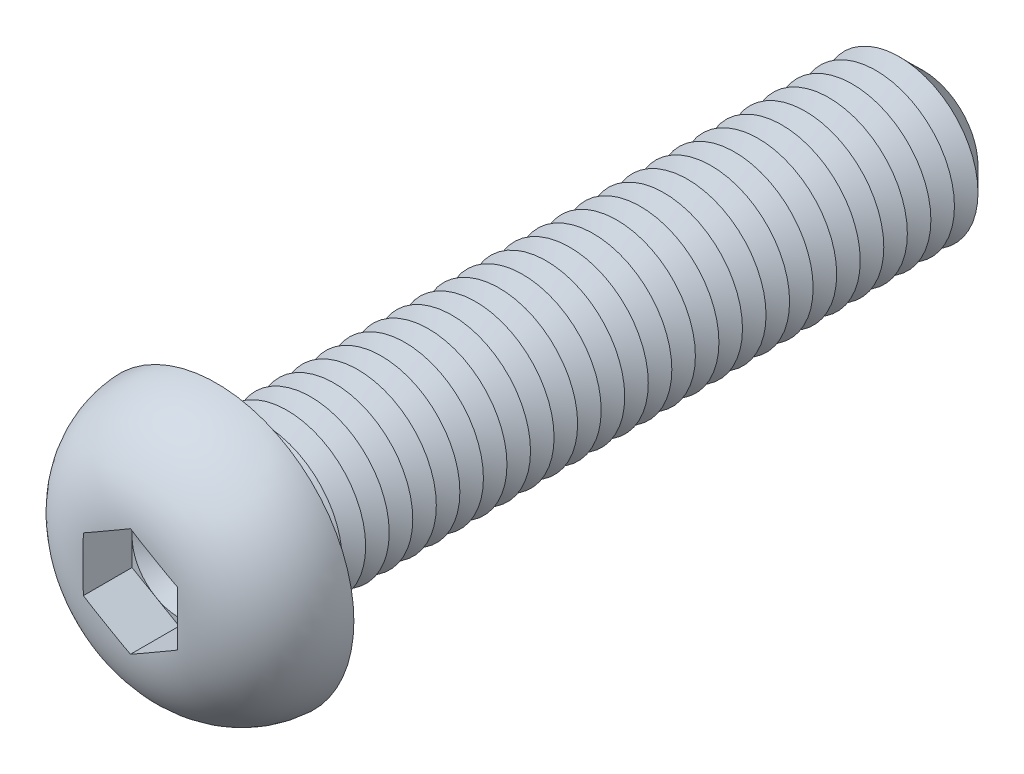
ISO-10303-21;
HEADER;
FILE_DESCRIPTION(('STEP AP214'),'2;1');
FILE_NAME('part.step','',(''),(''),'','','');
FILE_SCHEMA(('AUTOMOTIVE_DESIGN { 1 0 10303 214 1 1 1 1 }'));
ENDSEC;
DATA;
#1=APPLICATION_CONTEXT('core data for automotive mechanical design processes');
#2=APPLICATION_PROTOCOL_DEFINITION('international standard','automotive_design',2000,#1);
#3=PRODUCT_CONTEXT('',#1,'mechanical');
#4=PRODUCT('Part','Part','',(#3));
#5=PRODUCT_RELATED_PRODUCT_CATEGORY('part','',(#4));
#6=PRODUCT_DEFINITION_FORMATION('','',#4);
#7=PRODUCT_DEFINITION_CONTEXT('part definition',#1,'design');
#8=PRODUCT_DEFINITION('design','',#6,#7);
#9=PRODUCT_DEFINITION_SHAPE('','',#8);
#10=(LENGTH_UNIT() NAMED_UNIT(*) SI_UNIT(.MILLI.,.METRE.));
#11=(NAMED_UNIT(*) PLANE_ANGLE_UNIT() SI_UNIT($,.RADIAN.));
#12=(NAMED_UNIT(*) SI_UNIT($,.STERADIAN.) SOLID_ANGLE_UNIT());
#13=UNCERTAINTY_MEASURE_WITH_UNIT(LENGTH_MEASURE(1.E-05),#10,'distance_accuracy_value','');
#14=(GEOMETRIC_REPRESENTATION_CONTEXT(3) GLOBAL_UNCERTAINTY_ASSIGNED_CONTEXT((#13)) GLOBAL_UNIT_ASSIGNED_CONTEXT((#10,
#11,#12)) REPRESENTATION_CONTEXT('',''));
#15=CARTESIAN_POINT('',(0.,0.,0.));
#16=DIRECTION('',(0.,0.,1.));
#17=DIRECTION('',(1.,0.,0.));
#18=AXIS2_PLACEMENT_3D('',#15,#16,#17);
#19=CARTESIAN_POINT('',(0.,0.,2.38));
#20=DIRECTION('',(0.,0.,1.));
#21=DIRECTION('',(1.,0.,0.));
#22=AXIS2_PLACEMENT_3D('',#19,#20,#21);
#23=PLANE('',#22);
#24=CARTESIAN_POINT('',(0.,0.,2.38));
#25=DIRECTION('',(0.,0.,1.));
#26=DIRECTION('',(1.,0.,0.));
#27=AXIS2_PLACEMENT_3D('',#24,#25,#26);
#28=CIRCLE('',#27,3.);
#29=CARTESIAN_POINT('',(3.,0.,2.38));
#30=VERTEX_POINT('',#29);
#31=CARTESIAN_POINT('',(1.5,2.59807621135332,2.38));
#32=VERTEX_POINT('',#31);
#33=EDGE_CURVE('E117',#30,#32,#28,.T.);
#34=ORIENTED_EDGE('',*,*,#33,.F.);
#35=DIRECTION('',(0.,1.,0.));
#36=VECTOR('',#35,1.);
#37=CARTESIAN_POINT('',(3.,-1.73205080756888,2.38));
#38=LINE('',#37,#36);
#39=CARTESIAN_POINT('',(3.,1.73205080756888,2.38));
#40=VERTEX_POINT('',#39);
#41=EDGE_CURVE('E140',#30,#40,#38,.T.);
#42=ORIENTED_EDGE('',*,*,#41,.T.);
#43=DIRECTION('',(-0.866025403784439,0.5,0.));
#44=VECTOR('',#43,1.);
#45=CARTESIAN_POINT('',(3.,1.73205080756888,2.38));
#46=LINE('',#45,#44);
#47=EDGE_CURVE('E136',#40,#32,#46,.T.);
#48=ORIENTED_EDGE('',*,*,#47,.T.);
#49=EDGE_LOOP('',(#34,#42,#48));
#50=FACE_BOUND('',#49,.T.);
#51=ADVANCED_FACE('F39',(#50),#23,.T.);
#52=CARTESIAN_POINT('',(0.,0.,2.38));
#53=DIRECTION('',(0.,0.,1.));
#54=DIRECTION('',(1.,0.,0.));
#55=AXIS2_PLACEMENT_3D('',#52,#53,#54);
#56=CIRCLE('',#55,3.);
#57=CARTESIAN_POINT('',(-1.5,2.59807621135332,2.38));
#58=VERTEX_POINT('',#57);
#59=EDGE_CURVE('E11',#32,#58,#56,.T.);
#60=ORIENTED_EDGE('',*,*,#59,.F.);
#61=CARTESIAN_POINT('',(0.,3.46410161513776,2.38));
#62=VERTEX_POINT('',#61);
#63=EDGE_CURVE('E130',#32,#62,#46,.T.);
#64=ORIENTED_EDGE('',*,*,#63,.T.);
#65=DIRECTION('',(-0.866025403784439,-0.5,0.));
#66=VECTOR('',#65,1.);
#67=CARTESIAN_POINT('',(0.,3.46410161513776,2.38));
#68=LINE('',#67,#66);
#69=EDGE_CURVE('E131',#62,#58,#68,.T.);
#70=ORIENTED_EDGE('',*,*,#69,.T.);
#71=EDGE_LOOP('',(#60,#64,#70));
#72=FACE_BOUND('',#71,.T.);
#73=ADVANCED_FACE('F129',(#72),#23,.T.);
#74=CARTESIAN_POINT('',(-3.,0.,2.38));
#75=VERTEX_POINT('',#74);
#76=EDGE_CURVE('E49',#58,#75,#56,.T.);
#77=ORIENTED_EDGE('',*,*,#76,.F.);
#78=CARTESIAN_POINT('',(-3.,1.73205080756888,2.38));
#79=VERTEX_POINT('',#78);
#80=EDGE_CURVE('E143',#58,#79,#68,.T.);
#81=ORIENTED_EDGE('',*,*,#80,.T.);
#82=DIRECTION('',(0.,-1.,0.));
#83=VECTOR('',#82,1.);
#84=CARTESIAN_POINT('',(-3.,1.73205080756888,2.38));
#85=LINE('',#84,#83);
#86=EDGE_CURVE('E153',#79,#75,#85,.T.);
#87=ORIENTED_EDGE('',*,*,#86,.T.);
#88=EDGE_LOOP('',(#77,#81,#87));
#89=FACE_BOUND('',#88,.T.);
#90=ADVANCED_FACE('F270',(#89),#23,.T.);
#91=CARTESIAN_POINT('',(-1.5,-2.59807621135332,2.38));
#92=VERTEX_POINT('',#91);
#93=EDGE_CURVE('E253',#75,#92,#56,.T.);
#94=ORIENTED_EDGE('',*,*,#93,.F.);
#95=CARTESIAN_POINT('',(-3.,-1.73205080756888,2.38));
#96=VERTEX_POINT('',#95);
#97=EDGE_CURVE('E152',#75,#96,#85,.T.);
#98=ORIENTED_EDGE('',*,*,#97,.T.);
#99=DIRECTION('',(0.866025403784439,-0.5,0.));
#100=VECTOR('',#99,1.);
#101=CARTESIAN_POINT('',(-3.,-1.73205080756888,2.38));
#102=LINE('',#101,#100);
#103=EDGE_CURVE('E158',#96,#92,#102,.T.);
#104=ORIENTED_EDGE('',*,*,#103,.T.);
#105=EDGE_LOOP('',(#94,#98,#104));
#106=FACE_BOUND('',#105,.T.);
#107=ADVANCED_FACE('F264',(#106),#23,.T.);
#108=CARTESIAN_POINT('',(1.5,-2.59807621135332,2.38));
#109=VERTEX_POINT('',#108);
#110=EDGE_CURVE('E56',#92,#109,#56,.T.);
#111=ORIENTED_EDGE('',*,*,#110,.F.);
#112=CARTESIAN_POINT('',(0.,-3.46410161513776,2.38));
#113=VERTEX_POINT('',#112);
#114=EDGE_CURVE('E157',#92,#113,#102,.T.);
#115=ORIENTED_EDGE('',*,*,#114,.T.);
#116=DIRECTION('',(0.866025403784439,0.5,0.));
#117=VECTOR('',#116,1.);
#118=CARTESIAN_POINT('',(0.,-3.46410161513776,2.38));
#119=LINE('',#118,#117);
#120=EDGE_CURVE('E163',#113,#109,#119,.T.);
#121=ORIENTED_EDGE('',*,*,#120,.T.);
#122=EDGE_LOOP('',(#111,#115,#121));
#123=FACE_BOUND('',#122,.T.);
#124=ADVANCED_FACE('F308',(#123),#23,.T.);
#125=CARTESIAN_POINT('',(0.,0.,-45.));
#126=DIRECTION('',(0.,0.,1.));
#127=DIRECTION('',(1.,0.,0.));
#128=AXIS2_PLACEMENT_3D('',#125,#126,#127);
#129=CYLINDRICAL_SURFACE('',#128,5.);
#130=CARTESIAN_POINT('',(0.,0.,-0.600000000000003));
#131=DIRECTION('',(0.,0.,1.));
#132=DIRECTION('',(1.,0.,0.));
#133=AXIS2_PLACEMENT_3D('',#130,#131,#132);
#134=CIRCLE('',#133,5.);
#135=CARTESIAN_POINT('',(5.,0.,-0.60000000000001));
#136=VERTEX_POINT('',#135);
#137=EDGE_CURVE('E241',#136,#136,#134,.F.);
#138=CARTESIAN_POINT('',(0.,0.,-1.5));
#139=DIRECTION('',(0.,0.,1.));
#140=DIRECTION('',(1.,0.,0.));
#141=AXIS2_PLACEMENT_3D('',#138,#139,#140);
#142=CIRCLE('',#141,5.00000000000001);
#143=CARTESIAN_POINT('',(5.,0.,-1.50000000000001));
#144=VERTEX_POINT('',#143);
#145=EDGE_CURVE('E138',#144,#144,#142,.T.);
#146=CARTESIAN_POINT('',(5.,0.,-0.60000000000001));
#147=CARTESIAN_POINT('',(5.,0.,-0.609375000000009));
#148=CARTESIAN_POINT('',(5.,0.,-0.618750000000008));
#149=CARTESIAN_POINT('',(5.,0.,-0.637500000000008));
#150=CARTESIAN_POINT('',(5.,0.,-0.64687500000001));
#151=CARTESIAN_POINT('',(5.,0.,-0.66562500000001));
#152=CARTESIAN_POINT('',(5.,0.,-0.675000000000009));
#153=CARTESIAN_POINT('',(5.,0.,-0.693750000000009));
#154=CARTESIAN_POINT('',(5.,0.,-0.70312500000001));
#155=CARTESIAN_POINT('',(5.,0.,-0.721875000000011));
#156=CARTESIAN_POINT('',(5.,0.,-0.73125000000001));
#157=CARTESIAN_POINT('',(5.,0.,-0.75000000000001));
#158=CARTESIAN_POINT('',(5.,0.,-0.759375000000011));
#159=CARTESIAN_POINT('',(5.,0.,-0.778125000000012));
#160=CARTESIAN_POINT('',(5.,0.,-0.78750000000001));
#161=CARTESIAN_POINT('',(5.,0.,-0.806250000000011));
#162=CARTESIAN_POINT('',(5.,0.,-0.815625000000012));
#163=CARTESIAN_POINT('',(5.,0.,-0.834375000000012));
#164=CARTESIAN_POINT('',(5.,0.,-0.843750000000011));
#165=CARTESIAN_POINT('',(5.,0.,-0.862500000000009));
#166=CARTESIAN_POINT('',(5.,0.,-0.871875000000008));
#167=CARTESIAN_POINT('',(5.,0.,-0.890625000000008));
#168=CARTESIAN_POINT('',(5.,0.,-0.90000000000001));
#169=CARTESIAN_POINT('',(5.,0.,-0.91875000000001));
#170=CARTESIAN_POINT('',(5.,0.,-0.928125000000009));
#171=CARTESIAN_POINT('',(5.,0.,-0.946875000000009));
#172=CARTESIAN_POINT('',(5.,0.,-0.95625000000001));
#173=CARTESIAN_POINT('',(5.,0.,-0.975000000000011));
#174=CARTESIAN_POINT('',(5.,0.,-0.98437500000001));
#175=CARTESIAN_POINT('',(5.,0.,-1.00312500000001));
#176=CARTESIAN_POINT('',(5.,0.,-1.01250000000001));
#177=CARTESIAN_POINT('',(5.,0.,-1.03125000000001));
#178=CARTESIAN_POINT('',(5.,0.,-1.04062500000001));
#179=CARTESIAN_POINT('',(5.,0.,-1.05937500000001));
#180=CARTESIAN_POINT('',(5.,0.,-1.06875000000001));
#181=CARTESIAN_POINT('',(5.,0.,-1.08750000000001));
#182=CARTESIAN_POINT('',(5.,0.,-1.09687500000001));
#183=CARTESIAN_POINT('',(5.,0.,-1.11562500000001));
#184=CARTESIAN_POINT('',(5.,0.,-1.12500000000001));
#185=CARTESIAN_POINT('',(5.,0.,-1.14375000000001));
#186=CARTESIAN_POINT('',(5.,0.,-1.15312500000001));
#187=CARTESIAN_POINT('',(5.,0.,-1.17187500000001));
#188=CARTESIAN_POINT('',(5.,0.,-1.18125000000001));
#189=CARTESIAN_POINT('',(5.,0.,-1.20000000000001));
#190=CARTESIAN_POINT('',(5.,0.,-1.20937500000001));
#191=CARTESIAN_POINT('',(5.,0.,-1.22812500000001));
#192=CARTESIAN_POINT('',(5.,0.,-1.23750000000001));
#193=CARTESIAN_POINT('',(5.,0.,-1.25625000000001));
#194=CARTESIAN_POINT('',(5.,0.,-1.26562500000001));
#195=CARTESIAN_POINT('',(5.,0.,-1.28437500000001));
#196=CARTESIAN_POINT('',(5.,0.,-1.29375000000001));
#197=CARTESIAN_POINT('',(5.,0.,-1.31250000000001));
#198=CARTESIAN_POINT('',(5.,0.,-1.32187500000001));
#199=CARTESIAN_POINT('',(5.,0.,-1.34062500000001));
#200=CARTESIAN_POINT('',(5.,0.,-1.35000000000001));
#201=CARTESIAN_POINT('',(5.,0.,-1.36875000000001));
#202=CARTESIAN_POINT('',(5.,0.,-1.37812500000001));
#203=CARTESIAN_POINT('',(5.,0.,-1.39687500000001));
#204=CARTESIAN_POINT('',(5.,0.,-1.40625000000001));
#205=CARTESIAN_POINT('',(5.,0.,-1.42500000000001));
#206=CARTESIAN_POINT('',(5.,0.,-1.43437500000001));
#207=CARTESIAN_POINT('',(5.,0.,-1.45312500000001));
#208=CARTESIAN_POINT('',(5.,0.,-1.46250000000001));
#209=CARTESIAN_POINT('',(5.,0.,-1.48125000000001));
#210=CARTESIAN_POINT('',(5.,0.,-1.49062500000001));
#211=CARTESIAN_POINT('',(5.,0.,-1.50000000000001));
#212=B_SPLINE_CURVE_WITH_KNOTS('',3,(#146,#147,#148,#149,#150,#151,#152,#153,#154,#155,#156,
#157,#158,#159,#160,#161,#162,#163,#164,#165,#166,#167,#168,#169,#170,#171,#172,#173,#174,#175,
#176,#177,#178,#179,#180,#181,#182,#183,#184,#185,#186,#187,#188,#189,#190,#191,#192,#193,#194,
#195,#196,#197,#198,#199,#200,#201,#202,#203,#204,#205,#206,#207,#208,#209,#210,#211),
.UNSPECIFIED.,.F.,.F.,(4,2,2,2,2,2,2,2,2,2,2,2,2,2,2,2,2,2,2,2,2,2,2,2,2,2,2,2,2,2,2,2,4),(0.,
0.0281249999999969,0.0562500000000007,0.0843749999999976,0.112500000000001,0.140624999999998,
0.168750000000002,0.196874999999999,0.225000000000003,0.253125,0.281249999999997,
0.309375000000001,0.337499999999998,0.365625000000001,0.393749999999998,0.421875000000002,
0.449999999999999,0.478124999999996,0.50625,0.534374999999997,0.5625,0.590624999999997,
0.618750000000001,0.646874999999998,0.674999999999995,0.703124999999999,0.731249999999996,
0.759375,0.787499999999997,0.815625,0.843749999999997,0.871875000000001,0.899999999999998),.UNSPECIFIED.);
#213=EDGE_CURVE('BSEAM309',#136,#144,#212,.T.);
#214=ORIENTED_EDGE('',*,*,#137,.T.);
#215=ORIENTED_EDGE('',*,*,#145,.T.);
#216=ORIENTED_EDGE('',*,*,#213,.T.);
#217=ORIENTED_EDGE('',*,*,#213,.F.);
#218=EDGE_LOOP('',(#214,#216,#215,#217));
#219=FACE_BOUND('',#218,.T.);
#220=ADVANCED_FACE('F309',(#219),#129,.T.);
#221=CARTESIAN_POINT('',(0.,8.75,0.));
#222=DIRECTION('',(0.,0.,1.));
#223=DIRECTION('',(1.,0.,0.));
#224=AXIS2_PLACEMENT_3D('',#221,#222,#223);
#225=PLANE('',#224);
#226=CARTESIAN_POINT('',(0.,0.,0.));
#227=DIRECTION('',(0.,0.,1.));
#228=DIRECTION('',(1.,0.,0.));
#229=AXIS2_PLACEMENT_3D('',#226,#227,#228);
#230=CIRCLE('',#229,5.6);
#231=CARTESIAN_POINT('',(5.6,0.,0.));
#232=VERTEX_POINT('',#231);
#233=EDGE_CURVE('E244',#232,#232,#230,.T.);
#234=ORIENTED_EDGE('',*,*,#233,.T.);
#235=EDGE_LOOP('',(#234));
#236=FACE_BOUND('',#235,.T.);
#237=CARTESIAN_POINT('',(0.,0.,0.));
#238=DIRECTION('',(0.,0.,1.));
#239=DIRECTION('',(1.,0.,0.));
#240=AXIS2_PLACEMENT_3D('',#237,#238,#239);
#241=CIRCLE('',#240,8.75);
#242=CARTESIAN_POINT('',(8.75,0.,0.));
#243=VERTEX_POINT('',#242);
#244=EDGE_CURVE('E174',#243,#243,#241,.T.);
#245=ORIENTED_EDGE('',*,*,#244,.F.);
#246=EDGE_LOOP('',(#245));
#247=FACE_BOUND('',#246,.T.);
#248=ADVANCED_FACE('F312',(#236,#247),#225,.F.);
#249=CARTESIAN_POINT('',(0.,0.,-0.3));
#250=DIRECTION('',(0.,0.,1.));
#251=DIRECTION('',(1.,0.,0.));
#252=AXIS2_PLACEMENT_3D('',#249,#250,#251);
#253=DEGENERATE_TOROIDAL_SURFACE('',#252,2.95776381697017,5.8,.T.);
#254=CARTESIAN_POINT('',(-3.0002,1.73193533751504,5.47784605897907));
#255=CARTESIAN_POINT('',(-2.87524340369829,1.80407906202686,5.4841525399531));
#256=CARTESIAN_POINT('',(-2.75023731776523,1.87625135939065,5.48853670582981));
#257=CARTESIAN_POINT('',(-2.5001955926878,2.02061301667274,5.49472046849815));
#258=CARTESIAN_POINT('',(-2.37515996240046,2.09280237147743,5.49652051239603));
#259=CARTESIAN_POINT('',(-2.12510741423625,2.23717027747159,5.4987972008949));
#260=CARTESIAN_POINT('',(-2.00009049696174,2.30934882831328,5.49927407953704));
#261=CARTESIAN_POINT('',(-1.75004905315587,2.45371032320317,5.49979859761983));
#262=CARTESIAN_POINT('',(-1.62502452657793,2.52589326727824,5.49984621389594));
#263=CARTESIAN_POINT('',(-1.37497547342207,2.67025915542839,5.49984621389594));
#264=CARTESIAN_POINT('',(-1.24995094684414,2.74244209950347,5.49979859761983));
#265=CARTESIAN_POINT('',(-0.999909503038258,2.88680359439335,5.49927407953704));
#266=CARTESIAN_POINT('',(-0.874892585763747,2.95898214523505,5.4987972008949));
#267=CARTESIAN_POINT('',(-0.624840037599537,3.10335005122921,5.49652051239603));
#268=CARTESIAN_POINT('',(-0.499804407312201,3.1755394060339,5.49472046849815));
#269=CARTESIAN_POINT('',(-0.249762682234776,3.31990106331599,5.48853670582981));
#270=CARTESIAN_POINT('',(-0.124756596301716,3.39207336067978,5.4841525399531));
#271=CARTESIAN_POINT('',(0.000199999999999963,3.46421708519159,5.47784605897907));
#272=B_SPLINE_CURVE_WITH_KNOTS('',3,(#254,#255,#256,#257,#258,#259,#260,#261,#262,#263,#264,
#265,#266,#267,#268,#269,#270,#271),.UNSPECIFIED.,.F.,.F.,(4,2,2,2,2,2,2,2,4),(0.,
0.433225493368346,0.866376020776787,1.29944992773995,1.73254720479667,2.16564448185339,
2.59871838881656,3.031868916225,3.46509440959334),.UNSPECIFIED.);
#273=CARTESIAN_POINT('',(-3.,1.73205080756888,5.4778561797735));
#274=VERTEX_POINT('',#273);
#275=CARTESIAN_POINT('',(0.,3.46410161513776,5.4778561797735));
#276=VERTEX_POINT('',#275);
#277=EDGE_CURVE('E195',#274,#276,#272,.T.);
#278=ORIENTED_EDGE('',*,*,#277,.T.);
#279=CARTESIAN_POINT('',(-0.000200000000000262,3.46421708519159,5.47784605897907));
#280=CARTESIAN_POINT('',(0.124756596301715,3.39207336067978,5.4841525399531));
#281=CARTESIAN_POINT('',(0.249762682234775,3.31990106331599,5.48853670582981));
#282=CARTESIAN_POINT('',(0.4998044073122,3.1755394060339,5.49472046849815));
#283=CARTESIAN_POINT('',(0.624840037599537,3.10335005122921,5.49652051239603));
#284=CARTESIAN_POINT('',(0.874892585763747,2.95898214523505,5.4987972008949));
#285=CARTESIAN_POINT('',(0.999909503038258,2.88680359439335,5.49927407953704));
#286=CARTESIAN_POINT('',(1.24995094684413,2.74244209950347,5.49979859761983));
#287=CARTESIAN_POINT('',(1.37497547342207,2.67025915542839,5.49984621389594));
#288=CARTESIAN_POINT('',(1.62502452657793,2.52589326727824,5.49984621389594));
#289=CARTESIAN_POINT('',(1.75004905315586,2.45371032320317,5.49979859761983));
#290=CARTESIAN_POINT('',(2.00009049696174,2.30934882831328,5.49927407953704));
#291=CARTESIAN_POINT('',(2.12510741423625,2.23717027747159,5.4987972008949));
#292=CARTESIAN_POINT('',(2.37515996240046,2.09280237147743,5.49652051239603));
#293=CARTESIAN_POINT('',(2.5001955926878,2.02061301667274,5.49472046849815));
#294=CARTESIAN_POINT('',(2.75023731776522,1.87625135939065,5.48853670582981));
#295=CARTESIAN_POINT('',(2.87524340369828,1.80407906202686,5.4841525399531));
#296=CARTESIAN_POINT('',(3.0002,1.73193533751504,5.47784605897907));
#297=B_SPLINE_CURVE_WITH_KNOTS('',3,(#279,#280,#281,#282,#283,#284,#285,#286,#287,#288,#289,
#290,#291,#292,#293,#294,#295,#296),.UNSPECIFIED.,.F.,.F.,(4,2,2,2,2,2,2,2,4),(0.,
0.433225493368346,0.866376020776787,1.29944992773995,1.73254720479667,2.16564448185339,
2.59871838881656,3.031868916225,3.46509440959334),.UNSPECIFIED.);
#298=CARTESIAN_POINT('',(3.,1.73205080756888,5.47785617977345));
#299=VERTEX_POINT('',#298);
#300=EDGE_CURVE('E224',#276,#299,#297,.T.);
#301=ORIENTED_EDGE('',*,*,#300,.T.);
#302=CARTESIAN_POINT('',(3.,0.,5.49984621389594));
#303=CARTESIAN_POINT('',(3.,-0.125570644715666,5.49984449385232));
#304=CARTESIAN_POINT('',(3.,-0.251141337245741,5.49980426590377));
#305=CARTESIAN_POINT('',(3.,-0.502283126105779,5.499449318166));
#306=CARTESIAN_POINT('',(3.,-0.62785422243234,5.49913459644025));
#307=CARTESIAN_POINT('',(3.,-0.879037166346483,5.49770394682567));
#308=CARTESIAN_POINT('',(3.,-1.00464901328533,5.49658774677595));
#309=CARTESIAN_POINT('',(3.,-1.2558477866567,5.49279605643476));
#310=CARTESIAN_POINT('',(3.,-1.38143471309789,5.49012056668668));
#311=CARTESIAN_POINT('',(3.,-1.7568847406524,5.47847778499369));
#312=CARTESIAN_POINT('',(3.,-2.00667103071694,5.46590367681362));
#313=CARTESIAN_POINT('',(3.,-2.50488375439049,5.42441448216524));
#314=CARTESIAN_POINT('',(3.,-2.75331093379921,5.3955095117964));
#315=CARTESIAN_POINT('',(3.,-3.18719021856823,5.32582626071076));
#316=CARTESIAN_POINT('',(3.,-3.3733635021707,5.28960049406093));
#317=CARTESIAN_POINT('',(3.,-3.74245496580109,5.20330651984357));
#318=CARTESIAN_POINT('',(3.,-3.92537417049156,5.15324275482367));
#319=CARTESIAN_POINT('',(3.,-4.28675502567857,5.03819885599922));
#320=CARTESIAN_POINT('',(3.,-4.46521058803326,4.97319946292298));
#321=CARTESIAN_POINT('',(3.,-4.81576789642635,4.82782766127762));
#322=CARTESIAN_POINT('',(3.,-4.98786985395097,4.74745576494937));
#323=CARTESIAN_POINT('',(3.,-5.3254008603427,4.5705398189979));
#324=CARTESIAN_POINT('',(3.,-5.49076268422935,4.47386710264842));
#325=CARTESIAN_POINT('',(3.,-5.81151175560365,4.26514040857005));
#326=CARTESIAN_POINT('',(3.,-5.96689840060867,4.15308550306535));
#327=CARTESIAN_POINT('',(3.,-6.26591787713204,3.91428862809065));
#328=CARTESIAN_POINT('',(3.,-6.40955257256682,3.78754899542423));
#329=CARTESIAN_POINT('',(3.,-6.68342295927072,3.52034797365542));
#330=CARTESIAN_POINT('',(3.,-6.81366070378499,3.3798886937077));
#331=CARTESIAN_POINT('',(3.,-7.0426666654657,3.10626157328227));
#332=CARTESIAN_POINT('',(3.,-7.1433109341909,2.97465879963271));
#333=CARTESIAN_POINT('',(3.,-7.33253056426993,2.70304716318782));
#334=CARTESIAN_POINT('',(3.,-7.42110686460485,2.56303895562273));
#335=CARTESIAN_POINT('',(3.,-7.58534868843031,2.27573732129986));
#336=CARTESIAN_POINT('',(3.,-7.66102067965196,2.12844759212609));
#337=CARTESIAN_POINT('',(3.,-7.79881901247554,1.82765987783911));
#338=CARTESIAN_POINT('',(3.,-7.86094563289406,1.67416202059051));
#339=CARTESIAN_POINT('',(3.,-7.96803488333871,1.37082076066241));
#340=CARTESIAN_POINT('',(3.,-8.01375687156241,1.22124490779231));
#341=CARTESIAN_POINT('',(3.,-8.09224398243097,0.918674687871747));
#342=CARTESIAN_POINT('',(3.,-8.12500479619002,0.765679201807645));
#343=CARTESIAN_POINT('',(3.,-8.17726457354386,0.457507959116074));
#344=CARTESIAN_POINT('',(3.,-8.1967692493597,0.302333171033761));
#345=CARTESIAN_POINT('',(3.,-8.22238322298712,-0.00917738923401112));
#346=CARTESIAN_POINT('',(3.,-8.22848754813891,-0.165513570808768));
#347=CARTESIAN_POINT('',(3.,-8.22724693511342,-0.475358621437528));
#348=CARTESIAN_POINT('',(3.,-8.2201384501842,-0.628868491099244));
#349=CARTESIAN_POINT('',(3.,-8.1929851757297,-0.934809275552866));
#350=CARTESIAN_POINT('',(3.,-8.17293462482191,-1.0872396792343));
#351=CARTESIAN_POINT('',(3.,-8.1200547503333,-1.38984943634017));
#352=CARTESIAN_POINT('',(3.,-8.08722683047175,-1.54002903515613));
#353=CARTESIAN_POINT('',(3.,-8.0090712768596,-1.83702738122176));
#354=CARTESIAN_POINT('',(3.,-7.96374919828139,-1.98384759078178));
#355=CARTESIAN_POINT('',(3.,-7.86096457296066,-2.27315566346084));
#356=CARTESIAN_POINT('',(3.,-7.80350334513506,-2.41564399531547));
#357=CARTESIAN_POINT('',(3.,-7.67691451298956,-2.6952770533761));
#358=CARTESIAN_POINT('',(3.,-7.60779108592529,-2.83242367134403));
#359=CARTESIAN_POINT('',(3.,-7.45837210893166,-3.10056990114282));
#360=CARTESIAN_POINT('',(3.,-7.37807144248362,-3.23156666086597));
#361=CARTESIAN_POINT('',(3.,-7.20697634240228,-3.48645411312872));
#362=CARTESIAN_POINT('',(3.,-7.11618520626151,-3.61034702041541));
#363=CARTESIAN_POINT('',(3.,-6.92334779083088,-3.85210954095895));
#364=CARTESIAN_POINT('',(3.,-6.82115263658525,-3.96986038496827));
#365=CARTESIAN_POINT('',(3.,-6.60745266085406,-4.19658717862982));
#366=CARTESIAN_POINT('',(3.,-6.49594754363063,-4.30556284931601));
#367=CARTESIAN_POINT('',(3.,-6.26450055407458,-4.51413072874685));
#368=CARTESIAN_POINT('',(3.,-6.14455919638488,-4.61372350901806));
#369=CARTESIAN_POINT('',(3.,-5.8971402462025,-4.80306090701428));
#370=CARTESIAN_POINT('',(3.,-5.76966228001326,-4.89280503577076));
#371=CARTESIAN_POINT('',(3.,-5.50268934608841,-5.06561354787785));
#372=CARTESIAN_POINT('',(3.,-5.36291526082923,-5.14824654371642));
#373=CARTESIAN_POINT('',(3.,-5.07726499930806,-5.30226841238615));
#374=CARTESIAN_POINT('',(3.,-4.93138704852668,-5.37365398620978));
#375=CARTESIAN_POINT('',(3.,-4.63484455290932,-5.50505544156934));
#376=CARTESIAN_POINT('',(3.,-4.48418671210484,-5.56508649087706));
#377=CARTESIAN_POINT('',(3.,-4.17906596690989,-5.6740700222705));
#378=CARTESIAN_POINT('',(3.,-4.02460600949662,-5.72303080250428));
#379=CARTESIAN_POINT('',(3.,-3.6739247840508,-5.82125760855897));
#380=CARTESIAN_POINT('',(3.,-3.47687521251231,-5.86756841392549));
#381=CARTESIAN_POINT('',(3.,-3.07981530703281,-5.94521593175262));
#382=CARTESIAN_POINT('',(3.,-2.87980357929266,-5.97654534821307));
#383=CARTESIAN_POINT('',(3.,-2.47751859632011,-6.02656554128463));
#384=CARTESIAN_POINT('',(3.,-2.27523974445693,-6.0452096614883));
#385=CARTESIAN_POINT('',(3.,-1.8700786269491,-6.07274849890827));
#386=CARTESIAN_POINT('',(3.,-1.66719636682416,-6.08164330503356));
#387=CARTESIAN_POINT('',(3.,-1.25887867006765,-6.09343726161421));
#388=CARTESIAN_POINT('',(3.,-1.05344157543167,-6.09626381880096));
#389=CARTESIAN_POINT('',(3.,-0.745285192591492,-6.0985660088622));
#390=CARTESIAN_POINT('',(3.,-0.642567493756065,-6.09901047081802));
#391=CARTESIAN_POINT('',(3.,-0.437131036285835,-6.09957976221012));
#392=CARTESIAN_POINT('',(3.,-0.334412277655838,-6.09970459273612));
#393=CARTESIAN_POINT('',(3.,-0.129132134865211,-6.09984385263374));
#394=CARTESIAN_POINT('',(3.,-0.0265707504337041,-6.09985845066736));
#395=CARTESIAN_POINT('',(3.,0.178552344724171,-6.09981980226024));
#396=CARTESIAN_POINT('',(3.,0.281114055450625,-6.09976655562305));
#397=CARTESIAN_POINT('',(3.,0.486235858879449,-6.09946703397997));
#398=CARTESIAN_POINT('',(3.,0.588795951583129,-6.0992207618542));
#399=CARTESIAN_POINT('',(3.,0.793913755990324,-6.09826017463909));
#400=CARTESIAN_POINT('',(3.,0.896471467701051,-6.097545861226));
#401=CARTESIAN_POINT('',(3.,1.11088851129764,-6.0951586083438));
#402=CARTESIAN_POINT('',(3.,1.22274716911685,-6.0934045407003));
#403=CARTESIAN_POINT('',(3.,1.44642575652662,-6.08829151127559));
#404=CARTESIAN_POINT('',(3.,1.55824568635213,-6.08493255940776));
#405=CARTESIAN_POINT('',(3.,1.89360474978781,-6.07150074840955));
#406=CARTESIAN_POINT('',(3.,2.11703989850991,-6.05807293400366));
#407=CARTESIAN_POINT('',(3.,2.56083256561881,-6.01778675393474));
#408=CARTESIAN_POINT('',(3.,2.78120000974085,-5.99104517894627));
#409=CARTESIAN_POINT('',(3.,3.2192866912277,-5.92065658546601));
#410=CARTESIAN_POINT('',(3.,3.43700630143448,-5.8770119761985));
#411=CARTESIAN_POINT('',(3.,3.82666678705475,-5.78060449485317));
#412=CARTESIAN_POINT('',(3.,3.99942726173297,-5.73116262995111));
#413=CARTESIAN_POINT('',(3.,4.3405567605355,-5.61888897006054));
#414=CARTESIAN_POINT('',(3.,4.50892617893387,-5.55605838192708));
#415=CARTESIAN_POINT('',(3.,4.84049143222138,-5.41635874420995));
#416=CARTESIAN_POINT('',(3.,5.00366586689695,-5.33943871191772));
#417=CARTESIAN_POINT('',(3.,5.32271829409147,-5.17167128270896));
#418=CARTESIAN_POINT('',(3.,5.47859600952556,-5.0808233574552));
#419=CARTESIAN_POINT('',(3.,5.7822829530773,-4.88500135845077));
#420=CARTESIAN_POINT('',(3.,5.93005015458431,-4.77996197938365));
#421=CARTESIAN_POINT('',(3.,6.21523046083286,-4.55663689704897));
#422=CARTESIAN_POINT('',(3.,6.35264336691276,-4.43835093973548));
#423=CARTESIAN_POINT('',(3.,6.61552762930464,-4.18948618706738));
#424=CARTESIAN_POINT('',(3.,6.74101380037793,-4.05892305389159));
#425=CARTESIAN_POINT('',(3.,6.97891308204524,-3.78639059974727));
#426=CARTESIAN_POINT('',(3.,7.09132750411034,-3.64442242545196));
#427=CARTESIAN_POINT('',(3.,7.29113623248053,-3.36530209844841));
#428=CARTESIAN_POINT('',(3.,7.37991316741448,-3.22913733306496));
#429=CARTESIAN_POINT('',(3.,7.5451968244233,-2.94955428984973));
#430=CARTESIAN_POINT('',(3.,7.62170419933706,-2.80613639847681));
#431=CARTESIAN_POINT('',(3.,7.76177641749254,-2.5131168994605));
#432=CARTESIAN_POINT('',(3.,7.82534152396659,-2.36351541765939));
#433=CARTESIAN_POINT('',(3.,7.93897019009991,-2.05926799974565));
#434=CARTESIAN_POINT('',(3.,7.98903395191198,-1.9046221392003));
#435=CARTESIAN_POINT('',(3.,8.07336540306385,-1.59821781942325));
#436=CARTESIAN_POINT('',(3.,8.10821878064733,-1.44662026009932));
#437=CARTESIAN_POINT('',(3.,8.16487862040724,-1.14095089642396));
#438=CARTESIAN_POINT('',(3.,8.18668070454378,-0.986878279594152));
#439=CARTESIAN_POINT('',(3.,8.21703234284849,-0.677515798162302));
#440=CARTESIAN_POINT('',(3.,8.22558889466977,-0.522226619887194));
#441=CARTESIAN_POINT('',(3.,8.22940229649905,-0.211427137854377));
#442=CARTESIAN_POINT('',(3.,8.22465425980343,-0.0559167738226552));
#443=CARTESIAN_POINT('',(3.,8.20204101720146,0.252033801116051));
#444=CARTESIAN_POINT('',(3.,8.18435378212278,0.404487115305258));
#445=CARTESIAN_POINT('',(3.,8.136196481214,0.707418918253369));
#446=CARTESIAN_POINT('',(3.,8.1057217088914,0.857896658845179));
#447=CARTESIAN_POINT('',(3.,8.03224632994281,1.15569567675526));
#448=CARTESIAN_POINT('',(3.,7.9892508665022,1.30301822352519));
#449=CARTESIAN_POINT('',(3.,7.89104818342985,1.59360769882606));
#450=CARTESIAN_POINT('',(3.,7.83583549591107,1.73687277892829));
#451=CARTESIAN_POINT('',(3.,7.71349498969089,2.01864020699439));
#452=CARTESIAN_POINT('',(3.,7.64633814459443,2.1571299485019));
#453=CARTESIAN_POINT('',(3.,7.50076383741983,2.42797950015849));
#454=CARTESIAN_POINT('',(3.,7.42235122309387,2.56034191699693));
#455=CARTESIAN_POINT('',(3.,7.25483284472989,2.8181715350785));
#456=CARTESIAN_POINT('',(3.,7.16572386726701,2.94363664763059));
#457=CARTESIAN_POINT('',(3.,6.9775559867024,3.1867979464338));
#458=CARTESIAN_POINT('',(3.,6.87850037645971,3.30449668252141));
#459=CARTESIAN_POINT('',(3.,6.66919743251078,3.53363644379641));
#460=CARTESIAN_POINT('',(3.,6.55877281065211,3.6449154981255));
#461=CARTESIAN_POINT('',(3.,6.32925753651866,3.85806320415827));
#462=CARTESIAN_POINT('',(3.,6.21016952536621,3.95993470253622));
#463=CARTESIAN_POINT('',(3.,5.96413069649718,4.15386505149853));
#464=CARTESIAN_POINT('',(3.,5.83717459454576,4.24591719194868));
#465=CARTESIAN_POINT('',(3.,5.5764653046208,4.41973423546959));
#466=CARTESIAN_POINT('',(3.,5.4427139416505,4.50150188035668));
#467=CARTESIAN_POINT('',(3.,5.16249709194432,4.65840017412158));
#468=CARTESIAN_POINT('',(3.,5.01573037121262,4.73299250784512));
#469=CARTESIAN_POINT('',(3.,4.71685583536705,4.87057528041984));
#470=CARTESIAN_POINT('',(3.,4.56474751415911,4.93356461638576));
#471=CARTESIAN_POINT('',(3.,4.25657035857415,5.04801407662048));
#472=CARTESIAN_POINT('',(3.,4.10050882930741,5.09949395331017));
#473=CARTESIAN_POINT('',(3.,3.78523286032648,5.19149003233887));
#474=CARTESIAN_POINT('',(3.,3.62601895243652,5.23200806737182));
#475=CARTESIAN_POINT('',(3.,3.32461902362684,5.29856444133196));
#476=CARTESIAN_POINT('',(3.,3.18268434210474,5.32575733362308));
#477=CARTESIAN_POINT('',(3.,2.89760844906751,5.3729307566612));
#478=CARTESIAN_POINT('',(3.,2.75446703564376,5.39291005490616));
#479=CARTESIAN_POINT('',(3.,2.46730946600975,5.42656527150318));
#480=CARTESIAN_POINT('',(3.,2.32329255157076,5.44023457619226));
#481=CARTESIAN_POINT('',(3.,2.03487642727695,5.46234228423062));
#482=CARTESIAN_POINT('',(3.,1.89047722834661,5.4707808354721));
#483=CARTESIAN_POINT('',(3.,1.60058090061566,5.48373897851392));
#484=CARTESIAN_POINT('',(3.,1.45508270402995,5.48823290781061));
#485=CARTESIAN_POINT('',(3.,1.16402671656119,5.49458098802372));
#486=CARTESIAN_POINT('',(3.,1.01846892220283,5.49643495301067));
#487=CARTESIAN_POINT('',(3.,0.72742451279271,5.49877506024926));
#488=CARTESIAN_POINT('',(3.,0.581937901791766,5.49926194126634));
#489=CARTESIAN_POINT('',(3.,0.290967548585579,5.49979850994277));
#490=CARTESIAN_POINT('',(3.,0.145483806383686,5.49984820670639));
#491=CARTESIAN_POINT('',(3.,0.,5.49984621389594));
#492=B_SPLINE_CURVE_WITH_KNOTS('',3,(#302,#303,#304,#305,#306,#307,#308,#309,#310,#311,#312,
#313,#314,#315,#316,#317,#318,#319,#320,#321,#322,#323,#324,#325,#326,#327,#328,#329,#330,#331,
#332,#333,#334,#335,#336,#337,#338,#339,#340,#341,#342,#343,#344,#345,#346,#347,#348,#349,#350,
#351,#352,#353,#354,#355,#356,#357,#358,#359,#360,#361,#362,#363,#364,#365,#366,#367,#368,#369,
#370,#371,#372,#373,#374,#375,#376,#377,#378,#379,#380,#381,#382,#383,#384,#385,#386,#387,#388,
#389,#390,#391,#392,#393,#394,#395,#396,#397,#398,#399,#400,#401,#402,#403,#404,#405,#406,#407,
#408,#409,#410,#411,#412,#413,#414,#415,#416,#417,#418,#419,#420,#421,#422,#423,#424,#425,#426,
#427,#428,#429,#430,#431,#432,#433,#434,#435,#436,#437,#438,#439,#440,#441,#442,#443,#444,#445,
#446,#447,#448,#449,#450,#451,#452,#453,#454,#455,#456,#457,#458,#459,#460,#461,#462,#463,#464,
#465,#466,#467,#468,#469,#470,#471,#472,#473,#474,#475,#476,#477,#478,#479,#480,#481,#482,#483,
#484,#485,#486,#487,#488,#489,#490,#491),.UNSPECIFIED.,.T.,.F.,(4,2,2,2,2,2,2,2,2,2,2,2,2,2,2,2,
2,2,2,2,2,2,2,2,2,2,2,2,2,2,2,2,2,2,2,2,2,2,2,2,2,2,2,2,2,2,2,2,2,2,2,2,2,2,2,2,2,2,2,2,2,2,2,2,
2,2,2,2,2,2,2,2,2,2,2,2,2,2,2,2,2,2,2,2,2,2,2,2,2,2,2,2,2,2,4),(0.,0.376711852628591,
0.753426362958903,1.13026885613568,1.50711121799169,2.257095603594,3.00661592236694,
3.57514719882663,4.14349616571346,4.71258216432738,5.28164920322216,5.85543852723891,
6.42926247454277,7.00299523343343,7.57663992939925,8.07303876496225,8.56939895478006,
9.06550962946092,9.56161009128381,10.030267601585,10.4990807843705,10.9676918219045,
11.4364767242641,11.8969530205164,12.3576344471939,12.8182652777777,13.2786916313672,
13.7390679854,14.1992797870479,14.6597029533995,15.1199817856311,15.5871904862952,
16.0544140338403,16.5216091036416,16.9888273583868,17.4754224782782,17.9621600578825,
18.4482427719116,18.9339599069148,19.5405320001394,20.1473991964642,20.7564865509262,
21.3655683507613,21.9818967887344,22.2900536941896,22.5982095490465,22.905893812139,
23.2135789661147,23.5212595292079,23.8289389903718,24.1645461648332,24.5001512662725,
25.171371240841,25.8368042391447,26.5021424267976,27.0407309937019,27.5792710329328,
28.119799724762,28.660348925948,29.2034761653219,29.7466138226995,30.2890677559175,
30.831467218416,31.3185063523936,31.8055195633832,32.2925228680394,32.779518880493,
33.2456153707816,33.7118681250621,34.1778744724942,34.6440520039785,35.103935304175,
35.563988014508,36.0238520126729,36.4839222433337,36.9451261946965,37.4061321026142,
37.8672768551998,38.3282694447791,38.7980460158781,39.2676799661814,39.7376328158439,
40.207460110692,40.7008436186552,41.1942739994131,41.6868509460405,42.1793454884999,
42.6126940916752,43.0461167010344,43.479992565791,43.9138561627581,44.3505218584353,
44.7872183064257,45.2236787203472,45.6601300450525),.UNSPECIFIED.);
#493=CARTESIAN_POINT('',(3.,-1.73205080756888,5.4778561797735));
#494=VERTEX_POINT('',#493);
#495=EDGE_CURVE('E233',#299,#494,#492,.T.);
#496=ORIENTED_EDGE('',*,*,#495,.T.);
#497=CARTESIAN_POINT('',(3.0002,-1.73193533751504,5.47784605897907));
#498=CARTESIAN_POINT('',(2.87524340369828,-1.80407906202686,5.4841525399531));
#499=CARTESIAN_POINT('',(2.75023731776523,-1.87625135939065,5.48853670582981));
#500=CARTESIAN_POINT('',(2.5001955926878,-2.02061301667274,5.49472046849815));
#501=CARTESIAN_POINT('',(2.37515996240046,-2.09280237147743,5.49652051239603));
#502=CARTESIAN_POINT('',(2.12510741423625,-2.23717027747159,5.4987972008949));
#503=CARTESIAN_POINT('',(2.00009049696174,-2.30934882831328,5.49927407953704));
#504=CARTESIAN_POINT('',(1.75004905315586,-2.45371032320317,5.49979859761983));
#505=CARTESIAN_POINT('',(1.62502452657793,-2.52589326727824,5.49984621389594));
#506=CARTESIAN_POINT('',(1.37497547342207,-2.67025915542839,5.49984621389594));
#507=CARTESIAN_POINT('',(1.24995094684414,-2.74244209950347,5.49979859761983));
#508=CARTESIAN_POINT('',(0.999909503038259,-2.88680359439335,5.49927407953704));
#509=CARTESIAN_POINT('',(0.874892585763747,-2.95898214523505,5.4987972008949));
#510=CARTESIAN_POINT('',(0.624840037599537,-3.10335005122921,5.49652051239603));
#511=CARTESIAN_POINT('',(0.499804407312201,-3.1755394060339,5.49472046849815));
#512=CARTESIAN_POINT('',(0.249762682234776,-3.31990106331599,5.48853670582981));
#513=CARTESIAN_POINT('',(0.124756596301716,-3.39207336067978,5.4841525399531));
#514=CARTESIAN_POINT('',(-0.000199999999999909,-3.46421708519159,5.47784605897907));
#515=B_SPLINE_CURVE_WITH_KNOTS('',3,(#497,#498,#499,#500,#501,#502,#503,#504,#505,#506,#507,
#508,#509,#510,#511,#512,#513,#514),.UNSPECIFIED.,.F.,.F.,(4,2,2,2,2,2,2,2,4),(0.,
0.433225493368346,0.866376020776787,1.29944992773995,1.73254720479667,2.16564448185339,
2.59871838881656,3.031868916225,3.46509440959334),.UNSPECIFIED.);
#516=CARTESIAN_POINT('',(0.,-3.46410161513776,5.4778561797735));
#517=VERTEX_POINT('',#516);
#518=EDGE_CURVE('E282',#494,#517,#515,.T.);
#519=ORIENTED_EDGE('',*,*,#518,.T.);
#520=CARTESIAN_POINT('',(0.000200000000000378,-3.46421708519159,5.47784605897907));
#521=CARTESIAN_POINT('',(-0.124756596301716,-3.39207336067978,5.4841525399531));
#522=CARTESIAN_POINT('',(-0.249762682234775,-3.31990106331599,5.48853670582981));
#523=CARTESIAN_POINT('',(-0.499804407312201,-3.1755394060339,5.49472046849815));
#524=CARTESIAN_POINT('',(-0.624840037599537,-3.10335005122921,5.49652051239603));
#525=CARTESIAN_POINT('',(-0.874892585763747,-2.95898214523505,5.4987972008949));
#526=CARTESIAN_POINT('',(-0.999909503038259,-2.88680359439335,5.49927407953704));
#527=CARTESIAN_POINT('',(-1.24995094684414,-2.74244209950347,5.49979859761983));
#528=CARTESIAN_POINT('',(-1.37497547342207,-2.67025915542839,5.49984621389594));
#529=CARTESIAN_POINT('',(-1.62502452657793,-2.52589326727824,5.49984621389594));
#530=CARTESIAN_POINT('',(-1.75004905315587,-2.45371032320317,5.49979859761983));
#531=CARTESIAN_POINT('',(-2.00009049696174,-2.30934882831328,5.49927407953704));
#532=CARTESIAN_POINT('',(-2.12510741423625,-2.23717027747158,5.4987972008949));
#533=CARTESIAN_POINT('',(-2.37515996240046,-2.09280237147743,5.49652051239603));
#534=CARTESIAN_POINT('',(-2.5001955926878,-2.02061301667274,5.49472046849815));
#535=CARTESIAN_POINT('',(-2.75023731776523,-1.87625135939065,5.48853670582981));
#536=CARTESIAN_POINT('',(-2.87524340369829,-1.80407906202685,5.4841525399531));
#537=CARTESIAN_POINT('',(-3.0002,-1.73193533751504,5.47784605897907));
#538=B_SPLINE_CURVE_WITH_KNOTS('',3,(#520,#521,#522,#523,#524,#525,#526,#527,#528,#529,#530,
#531,#532,#533,#534,#535,#536,#537),.UNSPECIFIED.,.F.,.F.,(4,2,2,2,2,2,2,2,4),(0.,
0.433225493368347,0.866376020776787,1.29944992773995,1.73254720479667,2.16564448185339,
2.59871838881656,3.031868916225,3.46509440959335),.UNSPECIFIED.);
#539=CARTESIAN_POINT('',(-3.,-1.73205080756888,5.47785617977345));
#540=VERTEX_POINT('',#539);
#541=EDGE_CURVE('E277',#517,#540,#538,.T.);
#542=ORIENTED_EDGE('',*,*,#541,.T.);
#543=CARTESIAN_POINT('',(-3.,0.,5.49984621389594));
#544=CARTESIAN_POINT('',(-3.,0.125570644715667,5.49984449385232));
#545=CARTESIAN_POINT('',(-3.,0.251141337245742,5.49980426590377));
#546=CARTESIAN_POINT('',(-3.,0.50228312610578,5.499449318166));
#547=CARTESIAN_POINT('',(-3.,0.627854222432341,5.49913459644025));
#548=CARTESIAN_POINT('',(-3.,0.879037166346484,5.49770394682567));
#549=CARTESIAN_POINT('',(-3.,1.00464901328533,5.49658774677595));
#550=CARTESIAN_POINT('',(-3.,1.2558477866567,5.49279605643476));
#551=CARTESIAN_POINT('',(-3.,1.3814347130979,5.49012056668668));
#552=CARTESIAN_POINT('',(-3.,1.7568847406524,5.47847778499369));
#553=CARTESIAN_POINT('',(-3.,2.00667103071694,5.46590367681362));
#554=CARTESIAN_POINT('',(-3.,2.50488375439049,5.42441448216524));
#555=CARTESIAN_POINT('',(-3.,2.75331093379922,5.3955095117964));
#556=CARTESIAN_POINT('',(-3.,3.18719021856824,5.32582626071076));
#557=CARTESIAN_POINT('',(-3.,3.3733635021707,5.28960049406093));
#558=CARTESIAN_POINT('',(-3.,3.74245496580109,5.20330651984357));
#559=CARTESIAN_POINT('',(-3.,3.92537417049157,5.15324275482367));
#560=CARTESIAN_POINT('',(-3.,4.28675502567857,5.03819885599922));
#561=CARTESIAN_POINT('',(-3.,4.46521058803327,4.97319946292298));
#562=CARTESIAN_POINT('',(-3.,4.81576789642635,4.82782766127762));
#563=CARTESIAN_POINT('',(-3.,4.98786985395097,4.74745576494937));
#564=CARTESIAN_POINT('',(-3.,5.3254008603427,4.5705398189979));
#565=CARTESIAN_POINT('',(-3.,5.49076268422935,4.47386710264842));
#566=CARTESIAN_POINT('',(-3.,5.81151175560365,4.26514040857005));
#567=CARTESIAN_POINT('',(-3.,5.96689840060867,4.15308550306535));
#568=CARTESIAN_POINT('',(-3.,6.26591787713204,3.91428862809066));
#569=CARTESIAN_POINT('',(-3.,6.40955257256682,3.78754899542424));
#570=CARTESIAN_POINT('',(-3.,6.68342295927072,3.52034797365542));
#571=CARTESIAN_POINT('',(-3.,6.81366070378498,3.3798886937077));
#572=CARTESIAN_POINT('',(-3.,7.0426666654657,3.10626157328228));
#573=CARTESIAN_POINT('',(-3.,7.14331093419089,2.97465879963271));
#574=CARTESIAN_POINT('',(-3.,7.33253056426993,2.70304716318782));
#575=CARTESIAN_POINT('',(-3.,7.42110686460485,2.56303895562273));
#576=CARTESIAN_POINT('',(-3.,7.58534868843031,2.27573732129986));
#577=CARTESIAN_POINT('',(-3.,7.66102067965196,2.12844759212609));
#578=CARTESIAN_POINT('',(-3.,7.79881901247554,1.82765987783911));
#579=CARTESIAN_POINT('',(-3.,7.86094563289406,1.67416202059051));
#580=CARTESIAN_POINT('',(-3.,7.96803488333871,1.37082076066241));
#581=CARTESIAN_POINT('',(-3.,8.01375687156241,1.22124490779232));
#582=CARTESIAN_POINT('',(-3.,8.09224398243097,0.918674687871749));
#583=CARTESIAN_POINT('',(-3.,8.12500479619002,0.765679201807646));
#584=CARTESIAN_POINT('',(-3.,8.17726457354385,0.457507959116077));
#585=CARTESIAN_POINT('',(-3.,8.1967692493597,0.302333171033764));
#586=CARTESIAN_POINT('',(-3.,8.22238322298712,-0.00917738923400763));
#587=CARTESIAN_POINT('',(-3.,8.22848754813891,-0.165513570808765));
#588=CARTESIAN_POINT('',(-3.,8.22724693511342,-0.475358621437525));
#589=CARTESIAN_POINT('',(-3.,8.2201384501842,-0.628868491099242));
#590=CARTESIAN_POINT('',(-3.,8.1929851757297,-0.934809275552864));
#591=CARTESIAN_POINT('',(-3.,8.17293462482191,-1.08723967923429));
#592=CARTESIAN_POINT('',(-3.,8.1200547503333,-1.38984943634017));
#593=CARTESIAN_POINT('',(-3.,8.08722683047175,-1.54002903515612));
#594=CARTESIAN_POINT('',(-3.,8.0090712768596,-1.83702738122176));
#595=CARTESIAN_POINT('',(-3.,7.96374919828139,-1.98384759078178));
#596=CARTESIAN_POINT('',(-3.,7.86096457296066,-2.27315566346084));
#597=CARTESIAN_POINT('',(-3.,7.80350334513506,-2.41564399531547));
#598=CARTESIAN_POINT('',(-3.,7.67691451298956,-2.69527705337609));
#599=CARTESIAN_POINT('',(-3.,7.60779108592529,-2.83242367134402));
#600=CARTESIAN_POINT('',(-3.,7.45837210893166,-3.10056990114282));
#601=CARTESIAN_POINT('',(-3.,7.37807144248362,-3.23156666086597));
#602=CARTESIAN_POINT('',(-3.,7.20697634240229,-3.48645411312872));
#603=CARTESIAN_POINT('',(-3.,7.11618520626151,-3.61034702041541));
#604=CARTESIAN_POINT('',(-3.,6.92334779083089,-3.85210954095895));
#605=CARTESIAN_POINT('',(-3.,6.82115263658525,-3.96986038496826));
#606=CARTESIAN_POINT('',(-3.,6.60745266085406,-4.19658717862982));
#607=CARTESIAN_POINT('',(-3.,6.49594754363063,-4.30556284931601));
#608=CARTESIAN_POINT('',(-3.,6.26450055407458,-4.51413072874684));
#609=CARTESIAN_POINT('',(-3.,6.14455919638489,-4.61372350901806));
#610=CARTESIAN_POINT('',(-3.,5.8971402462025,-4.80306090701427));
#611=CARTESIAN_POINT('',(-3.,5.76966228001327,-4.89280503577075));
#612=CARTESIAN_POINT('',(-3.,5.50268934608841,-5.06561354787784));
#613=CARTESIAN_POINT('',(-3.,5.36291526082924,-5.14824654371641));
#614=CARTESIAN_POINT('',(-3.,5.07726499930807,-5.30226841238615));
#615=CARTESIAN_POINT('',(-3.,4.93138704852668,-5.37365398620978));
#616=CARTESIAN_POINT('',(-3.,4.63484455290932,-5.50505544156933));
#617=CARTESIAN_POINT('',(-3.,4.48418671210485,-5.56508649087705));
#618=CARTESIAN_POINT('',(-3.,4.17906596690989,-5.6740700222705));
#619=CARTESIAN_POINT('',(-3.,4.02460600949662,-5.72303080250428));
#620=CARTESIAN_POINT('',(-3.,3.6739247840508,-5.82125760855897));
#621=CARTESIAN_POINT('',(-3.,3.47687521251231,-5.86756841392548));
#622=CARTESIAN_POINT('',(-3.,3.07981530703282,-5.94521593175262));
#623=CARTESIAN_POINT('',(-3.,2.87980357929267,-5.97654534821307));
#624=CARTESIAN_POINT('',(-3.,2.47751859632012,-6.02656554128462));
#625=CARTESIAN_POINT('',(-3.,2.27523974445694,-6.0452096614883));
#626=CARTESIAN_POINT('',(-3.,1.87007862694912,-6.07274849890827));
#627=CARTESIAN_POINT('',(-3.,1.66719636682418,-6.08164330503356));
#628=CARTESIAN_POINT('',(-3.,1.25887867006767,-6.09343726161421));
#629=CARTESIAN_POINT('',(-3.,1.05344157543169,-6.09626381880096));
#630=CARTESIAN_POINT('',(-3.,0.745285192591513,-6.0985660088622));
#631=CARTESIAN_POINT('',(-3.,0.642567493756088,-6.09901047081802));
#632=CARTESIAN_POINT('',(-3.,0.437131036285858,-6.09957976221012));
#633=CARTESIAN_POINT('',(-3.,0.334412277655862,-6.09970459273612));
#634=CARTESIAN_POINT('',(-3.,0.129132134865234,-6.09984385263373));
#635=CARTESIAN_POINT('',(-3.,0.0265707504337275,-6.09985845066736));
#636=CARTESIAN_POINT('',(-3.,-0.178552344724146,-6.09981980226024));
#637=CARTESIAN_POINT('',(-3.,-0.281114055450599,-6.09976655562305));
#638=CARTESIAN_POINT('',(-3.,-0.486235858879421,-6.09946703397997));
#639=CARTESIAN_POINT('',(-3.,-0.588795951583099,-6.0992207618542));
#640=CARTESIAN_POINT('',(-3.,-0.793913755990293,-6.09826017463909));
#641=CARTESIAN_POINT('',(-3.,-0.89647146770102,-6.097545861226));
#642=CARTESIAN_POINT('',(-3.,-1.11088851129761,-6.0951586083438));
#643=CARTESIAN_POINT('',(-3.,-1.22274716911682,-6.0934045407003));
#644=CARTESIAN_POINT('',(-3.,-1.44642575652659,-6.08829151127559));
#645=CARTESIAN_POINT('',(-3.,-1.55824568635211,-6.08493255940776));
#646=CARTESIAN_POINT('',(-3.,-1.89360474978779,-6.07150074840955));
#647=CARTESIAN_POINT('',(-3.,-2.11703989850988,-6.05807293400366));
#648=CARTESIAN_POINT('',(-3.,-2.56083256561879,-6.01778675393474));
#649=CARTESIAN_POINT('',(-3.,-2.78120000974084,-5.99104517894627));
#650=CARTESIAN_POINT('',(-3.,-3.21928669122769,-5.92065658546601));
#651=CARTESIAN_POINT('',(-3.,-3.43700630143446,-5.8770119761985));
#652=CARTESIAN_POINT('',(-3.,-3.82666678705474,-5.78060449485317));
#653=CARTESIAN_POINT('',(-3.,-3.99942726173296,-5.73116262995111));
#654=CARTESIAN_POINT('',(-3.,-4.34055676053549,-5.61888897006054));
#655=CARTESIAN_POINT('',(-3.,-4.50892617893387,-5.55605838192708));
#656=CARTESIAN_POINT('',(-3.,-4.84049143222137,-5.41635874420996));
#657=CARTESIAN_POINT('',(-3.,-5.00366586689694,-5.33943871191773));
#658=CARTESIAN_POINT('',(-3.,-5.32271829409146,-5.17167128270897));
#659=CARTESIAN_POINT('',(-3.,-5.47859600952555,-5.08082335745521));
#660=CARTESIAN_POINT('',(-3.,-5.78228295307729,-4.88500135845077));
#661=CARTESIAN_POINT('',(-3.,-5.9300501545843,-4.77996197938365));
#662=CARTESIAN_POINT('',(-3.,-6.21523046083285,-4.55663689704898));
#663=CARTESIAN_POINT('',(-3.,-6.35264336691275,-4.43835093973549));
#664=CARTESIAN_POINT('',(-3.,-6.61552762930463,-4.18948618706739));
#665=CARTESIAN_POINT('',(-3.,-6.74101380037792,-4.05892305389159));
#666=CARTESIAN_POINT('',(-3.,-6.97891308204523,-3.78639059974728));
#667=CARTESIAN_POINT('',(-3.,-7.09132750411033,-3.64442242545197));
#668=CARTESIAN_POINT('',(-3.,-7.29113623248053,-3.36530209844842));
#669=CARTESIAN_POINT('',(-3.,-7.37991316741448,-3.22913733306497));
#670=CARTESIAN_POINT('',(-3.,-7.54519682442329,-2.94955428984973));
#671=CARTESIAN_POINT('',(-3.,-7.62170419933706,-2.80613639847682));
#672=CARTESIAN_POINT('',(-3.,-7.76177641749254,-2.5131168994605));
#673=CARTESIAN_POINT('',(-3.,-7.82534152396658,-2.3635154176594));
#674=CARTESIAN_POINT('',(-3.,-7.93897019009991,-2.05926799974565));
#675=CARTESIAN_POINT('',(-3.,-7.98903395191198,-1.9046221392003));
#676=CARTESIAN_POINT('',(-3.,-8.07336540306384,-1.59821781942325));
#677=CARTESIAN_POINT('',(-3.,-8.10821878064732,-1.44662026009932));
#678=CARTESIAN_POINT('',(-3.,-8.16487862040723,-1.14095089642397));
#679=CARTESIAN_POINT('',(-3.,-8.18668070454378,-0.986878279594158));
#680=CARTESIAN_POINT('',(-3.,-8.21703234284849,-0.677515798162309));
#681=CARTESIAN_POINT('',(-3.,-8.22558889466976,-0.522226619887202));
#682=CARTESIAN_POINT('',(-3.,-8.22940229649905,-0.211427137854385));
#683=CARTESIAN_POINT('',(-3.,-8.22465425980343,-0.0559167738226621));
#684=CARTESIAN_POINT('',(-3.,-8.20204101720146,0.252033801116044));
#685=CARTESIAN_POINT('',(-3.,-8.18435378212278,0.40448711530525));
#686=CARTESIAN_POINT('',(-3.,-8.136196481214,0.707418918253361));
#687=CARTESIAN_POINT('',(-3.,-8.1057217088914,0.857896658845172));
#688=CARTESIAN_POINT('',(-3.,-8.03224632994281,1.15569567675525));
#689=CARTESIAN_POINT('',(-3.,-7.9892508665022,1.30301822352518));
#690=CARTESIAN_POINT('',(-3.,-7.89104818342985,1.59360769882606));
#691=CARTESIAN_POINT('',(-3.,-7.83583549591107,1.73687277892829));
#692=CARTESIAN_POINT('',(-3.,-7.71349498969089,2.01864020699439));
#693=CARTESIAN_POINT('',(-3.,-7.64633814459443,2.1571299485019));
#694=CARTESIAN_POINT('',(-3.,-7.50076383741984,2.42797950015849));
#695=CARTESIAN_POINT('',(-3.,-7.42235122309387,2.56034191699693));
#696=CARTESIAN_POINT('',(-3.,-7.25483284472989,2.81817153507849));
#697=CARTESIAN_POINT('',(-3.,-7.16572386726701,2.94363664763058));
#698=CARTESIAN_POINT('',(-3.,-6.97755598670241,3.1867979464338));
#699=CARTESIAN_POINT('',(-3.,-6.87850037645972,3.30449668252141));
#700=CARTESIAN_POINT('',(-3.,-6.66919743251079,3.53363644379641));
#701=CARTESIAN_POINT('',(-3.,-6.55877281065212,3.64491549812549));
#702=CARTESIAN_POINT('',(-3.,-6.32925753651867,3.85806320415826));
#703=CARTESIAN_POINT('',(-3.,-6.21016952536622,3.95993470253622));
#704=CARTESIAN_POINT('',(-3.,-5.96413069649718,4.15386505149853));
#705=CARTESIAN_POINT('',(-3.,-5.83717459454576,4.24591719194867));
#706=CARTESIAN_POINT('',(-3.,-5.5764653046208,4.41973423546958));
#707=CARTESIAN_POINT('',(-3.,-5.4427139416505,4.50150188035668));
#708=CARTESIAN_POINT('',(-3.,-5.16249709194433,4.65840017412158));
#709=CARTESIAN_POINT('',(-3.,-5.01573037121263,4.73299250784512));
#710=CARTESIAN_POINT('',(-3.,-4.71685583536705,4.87057528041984));
#711=CARTESIAN_POINT('',(-3.,-4.56474751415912,4.93356461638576));
#712=CARTESIAN_POINT('',(-3.,-4.25657035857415,5.04801407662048));
#713=CARTESIAN_POINT('',(-3.,-4.10050882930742,5.09949395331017));
#714=CARTESIAN_POINT('',(-3.,-3.78523286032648,5.19149003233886));
#715=CARTESIAN_POINT('',(-3.,-3.62601895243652,5.23200806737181));
#716=CARTESIAN_POINT('',(-3.,-3.32461902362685,5.29856444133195));
#717=CARTESIAN_POINT('',(-3.,-3.18268434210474,5.32575733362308));
#718=CARTESIAN_POINT('',(-3.,-2.89760844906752,5.3729307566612));
#719=CARTESIAN_POINT('',(-3.,-2.75446703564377,5.39291005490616));
#720=CARTESIAN_POINT('',(-3.,-2.46730946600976,5.42656527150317));
#721=CARTESIAN_POINT('',(-3.,-2.32329255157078,5.44023457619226));
#722=CARTESIAN_POINT('',(-3.,-2.03487642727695,5.46234228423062));
#723=CARTESIAN_POINT('',(-3.,-1.89047722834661,5.4707808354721));
#724=CARTESIAN_POINT('',(-3.,-1.60058090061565,5.48373897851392));
#725=CARTESIAN_POINT('',(-3.,-1.45508270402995,5.48823290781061));
#726=CARTESIAN_POINT('',(-3.,-1.16402671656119,5.49458098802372));
#727=CARTESIAN_POINT('',(-3.,-1.01846892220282,5.49643495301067));
#728=CARTESIAN_POINT('',(-3.,-0.727424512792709,5.49877506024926));
#729=CARTESIAN_POINT('',(-3.,-0.581937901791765,5.49926194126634));
#730=CARTESIAN_POINT('',(-3.,-0.290967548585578,5.49979850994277));
#731=CARTESIAN_POINT('',(-3.,-0.145483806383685,5.49984820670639));
#732=CARTESIAN_POINT('',(-3.,0.,5.49984621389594));
#733=B_SPLINE_CURVE_WITH_KNOTS('',3,(#543,#544,#545,#546,#547,#548,#549,#550,#551,#552,#553,
#554,#555,#556,#557,#558,#559,#560,#561,#562,#563,#564,#565,#566,#567,#568,#569,#570,#571,#572,
#573,#574,#575,#576,#577,#578,#579,#580,#581,#582,#583,#584,#585,#586,#587,#588,#589,#590,#591,
#592,#593,#594,#595,#596,#597,#598,#599,#600,#601,#602,#603,#604,#605,#606,#607,#608,#609,#610,
#611,#612,#613,#614,#615,#616,#617,#618,#619,#620,#621,#622,#623,#624,#625,#626,#627,#628,#629,
#630,#631,#632,#633,#634,#635,#636,#637,#638,#639,#640,#641,#642,#643,#644,#645,#646,#647,#648,
#649,#650,#651,#652,#653,#654,#655,#656,#657,#658,#659,#660,#661,#662,#663,#664,#665,#666,#667,
#668,#669,#670,#671,#672,#673,#674,#675,#676,#677,#678,#679,#680,#681,#682,#683,#684,#685,#686,
#687,#688,#689,#690,#691,#692,#693,#694,#695,#696,#697,#698,#699,#700,#701,#702,#703,#704,#705,
#706,#707,#708,#709,#710,#711,#712,#713,#714,#715,#716,#717,#718,#719,#720,#721,#722,#723,#724,
#725,#726,#727,#728,#729,#730,#731,#732),.UNSPECIFIED.,.T.,.F.,(4,2,2,2,2,2,2,2,2,2,2,2,2,2,2,2,
2,2,2,2,2,2,2,2,2,2,2,2,2,2,2,2,2,2,2,2,2,2,2,2,2,2,2,2,2,2,2,2,2,2,2,2,2,2,2,2,2,2,2,2,2,2,2,2,
2,2,2,2,2,2,2,2,2,2,2,2,2,2,2,2,2,2,2,2,2,2,2,2,2,2,2,2,2,2,4),(0.,0.376711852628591,
0.753426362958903,1.13026885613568,1.50711121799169,2.257095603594,3.00661592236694,
3.57514719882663,4.14349616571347,4.71258216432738,5.28164920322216,5.85543852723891,
6.42926247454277,7.00299523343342,7.57663992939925,8.07303876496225,8.56939895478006,
9.06550962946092,9.56161009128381,10.030267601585,10.4990807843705,10.9676918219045,
11.4364767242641,11.8969530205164,12.3576344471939,12.8182652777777,13.2786916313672,
13.7390679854,14.1992797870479,14.6597029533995,15.1199817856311,15.5871904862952,
16.0544140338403,16.5216091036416,16.9888273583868,17.4754224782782,17.9621600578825,
18.4482427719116,18.9339599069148,19.5405320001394,20.1473991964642,20.7564865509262,
21.3655683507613,21.9818967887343,22.2900536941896,22.5982095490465,22.905893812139,
23.2135789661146,23.5212595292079,23.8289389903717,24.1645461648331,24.5001512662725,
25.171371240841,25.8368042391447,26.5021424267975,27.0407309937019,27.5792710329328,
28.1197997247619,28.6603489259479,29.2034761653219,29.7466138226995,30.2890677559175,
30.831467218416,31.3185063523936,31.8055195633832,32.2925228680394,32.779518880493,
33.2456153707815,33.711868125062,34.1778744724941,34.6440520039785,35.103935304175,
35.563988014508,36.0238520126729,36.4839222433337,36.9451261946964,37.4061321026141,
37.8672768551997,38.3282694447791,38.798046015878,39.2676799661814,39.7376328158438,
40.207460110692,40.7008436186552,41.194273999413,41.6868509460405,42.1793454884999,
42.6126940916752,43.0461167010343,43.479992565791,43.913856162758,44.3505218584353,
44.7872183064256,45.2236787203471,45.6601300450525),.UNSPECIFIED.);
#734=EDGE_CURVE('E204',#540,#274,#733,.T.);
#735=ORIENTED_EDGE('',*,*,#734,.T.);
#736=EDGE_LOOP('',(#278,#301,#496,#519,#542,#735));
#737=FACE_BOUND('',#736,.T.);
#738=ORIENTED_EDGE('',*,*,#244,.T.);
#739=EDGE_LOOP('',(#738));
#740=FACE_BOUND('',#739,.T.);
#741=ADVANCED_FACE('F209',(#737,#740),#253,.T.);
#742=CARTESIAN_POINT('',(3.,1.73205080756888,2.38));
#743=DIRECTION('',(0.5,0.866025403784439,0.));
#744=DIRECTION('',(-0.866025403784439,0.5,0.));
#745=AXIS2_PLACEMENT_3D('',#742,#743,#744);
#746=PLANE('',#745);
#747=DIRECTION('',(0.,0.,1.));
#748=VECTOR('',#747,1.);
#749=CARTESIAN_POINT('',(0.,3.46410161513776,2.38));
#750=LINE('',#749,#748);
#751=EDGE_CURVE('E64',#62,#276,#750,.T.);
#752=ORIENTED_EDGE('',*,*,#751,.F.);
#753=ORIENTED_EDGE('',*,*,#63,.F.);
#754=ORIENTED_EDGE('',*,*,#47,.F.);
#755=DIRECTION('',(0.,0.,1.));
#756=VECTOR('',#755,1.);
#757=CARTESIAN_POINT('',(3.,1.73205080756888,2.38));
#758=LINE('',#757,#756);
#759=EDGE_CURVE('E171',#40,#299,#758,.T.);
#760=ORIENTED_EDGE('',*,*,#759,.T.);
#761=ORIENTED_EDGE('',*,*,#300,.F.);
#762=EDGE_LOOP('',(#752,#753,#754,#760,#761));
#763=FACE_BOUND('',#762,.T.);
#764=ADVANCED_FACE('F134',(#763),#746,.F.);
#765=CARTESIAN_POINT('',(3.,-1.73205080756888,2.38));
#766=DIRECTION('',(1.,0.,0.));
#767=DIRECTION('',(0.,1.,0.));
#768=AXIS2_PLACEMENT_3D('',#765,#766,#767);
#769=PLANE('',#768);
#770=ORIENTED_EDGE('',*,*,#759,.F.);
#771=ORIENTED_EDGE('',*,*,#41,.F.);
#772=CARTESIAN_POINT('',(3.,-1.73205080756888,2.38));
#773=VERTEX_POINT('',#772);
#774=EDGE_CURVE('E167',#773,#30,#38,.T.);
#775=ORIENTED_EDGE('',*,*,#774,.F.);
#776=DIRECTION('',(0.,0.,1.));
#777=VECTOR('',#776,1.);
#778=CARTESIAN_POINT('',(3.,-1.73205080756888,2.38));
#779=LINE('',#778,#777);
#780=EDGE_CURVE('E175',#773,#494,#779,.T.);
#781=ORIENTED_EDGE('',*,*,#780,.T.);
#782=ORIENTED_EDGE('',*,*,#495,.F.);
#783=EDGE_LOOP('',(#770,#771,#775,#781,#782));
#784=FACE_BOUND('',#783,.T.);
#785=ADVANCED_FACE('F222',(#784),#769,.F.);
#786=CARTESIAN_POINT('',(0.,-3.46410161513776,2.38));
#787=DIRECTION('',(0.5,-0.866025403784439,0.));
#788=DIRECTION('',(0.866025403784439,0.5,0.));
#789=AXIS2_PLACEMENT_3D('',#786,#787,#788);
#790=PLANE('',#789);
#791=ORIENTED_EDGE('',*,*,#780,.F.);
#792=EDGE_CURVE('E162',#109,#773,#119,.T.);
#793=ORIENTED_EDGE('',*,*,#792,.F.);
#794=ORIENTED_EDGE('',*,*,#120,.F.);
#795=DIRECTION('',(0.,0.,1.));
#796=VECTOR('',#795,1.);
#797=CARTESIAN_POINT('',(0.,-3.46410161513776,2.38));
#798=LINE('',#797,#796);
#799=EDGE_CURVE('E179',#113,#517,#798,.T.);
#800=ORIENTED_EDGE('',*,*,#799,.T.);
#801=ORIENTED_EDGE('',*,*,#518,.F.);
#802=EDGE_LOOP('',(#791,#793,#794,#800,#801));
#803=FACE_BOUND('',#802,.T.);
#804=ADVANCED_FACE('F295',(#803),#790,.F.);
#805=CARTESIAN_POINT('',(-3.,-1.73205080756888,2.38));
#806=DIRECTION('',(-0.5,-0.866025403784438,0.));
#807=DIRECTION('',(0.866025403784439,-0.5,0.));
#808=AXIS2_PLACEMENT_3D('',#805,#806,#807);
#809=PLANE('',#808);
#810=ORIENTED_EDGE('',*,*,#799,.F.);
#811=ORIENTED_EDGE('',*,*,#114,.F.);
#812=ORIENTED_EDGE('',*,*,#103,.F.);
#813=DIRECTION('',(0.,0.,1.));
#814=VECTOR('',#813,1.);
#815=CARTESIAN_POINT('',(-3.,-1.73205080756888,2.38));
#816=LINE('',#815,#814);
#817=EDGE_CURVE('E182',#96,#540,#816,.T.);
#818=ORIENTED_EDGE('',*,*,#817,.T.);
#819=ORIENTED_EDGE('',*,*,#541,.F.);
#820=EDGE_LOOP('',(#810,#811,#812,#818,#819));
#821=FACE_BOUND('',#820,.T.);
#822=ADVANCED_FACE('F292',(#821),#809,.F.);
#823=CARTESIAN_POINT('',(-3.,1.73205080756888,2.38));
#824=DIRECTION('',(-1.,0.,0.));
#825=DIRECTION('',(0.,-1.,0.));
#826=AXIS2_PLACEMENT_3D('',#823,#824,#825);
#827=PLANE('',#826);
#828=ORIENTED_EDGE('',*,*,#817,.F.);
#829=ORIENTED_EDGE('',*,*,#97,.F.);
#830=ORIENTED_EDGE('',*,*,#86,.F.);
#831=DIRECTION('',(0.,0.,1.));
#832=VECTOR('',#831,1.);
#833=CARTESIAN_POINT('',(-3.,1.73205080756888,2.38));
#834=LINE('',#833,#832);
#835=EDGE_CURVE('E186',#79,#274,#834,.T.);
#836=ORIENTED_EDGE('',*,*,#835,.T.);
#837=ORIENTED_EDGE('',*,*,#734,.F.);
#838=EDGE_LOOP('',(#828,#829,#830,#836,#837));
#839=FACE_BOUND('',#838,.T.);
#840=ADVANCED_FACE('F217',(#839),#827,.F.);
#841=CARTESIAN_POINT('',(0.,3.46410161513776,2.38));
#842=DIRECTION('',(-0.5,0.866025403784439,0.));
#843=DIRECTION('',(-0.866025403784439,-0.5,0.));
#844=AXIS2_PLACEMENT_3D('',#841,#842,#843);
#845=PLANE('',#844);
#846=ORIENTED_EDGE('',*,*,#835,.F.);
#847=ORIENTED_EDGE('',*,*,#80,.F.);
#848=ORIENTED_EDGE('',*,*,#69,.F.);
#849=ORIENTED_EDGE('',*,*,#751,.T.);
#850=ORIENTED_EDGE('',*,*,#277,.F.);
#851=EDGE_LOOP('',(#846,#847,#848,#849,#850));
#852=FACE_BOUND('',#851,.T.);
#853=ADVANCED_FACE('F213',(#852),#845,.F.);
#854=EDGE_CURVE('E43',#109,#30,#56,.T.);
#855=ORIENTED_EDGE('',*,*,#854,.F.);
#856=ORIENTED_EDGE('',*,*,#792,.T.);
#857=ORIENTED_EDGE('',*,*,#774,.T.);
#858=EDGE_LOOP('',(#855,#856,#857));
#859=FACE_BOUND('',#858,.T.);
#860=ADVANCED_FACE('F216',(#859),#23,.T.);
#861=CARTESIAN_POINT('',(0.,0.,-1.5));
#862=DIRECTION('',(0.,0.,1.));
#863=DIRECTION('',(1.,0.,0.));
#864=AXIS2_PLACEMENT_3D('',#861,#862,#863);
#865=CONICAL_SURFACE('',#864,5.00000000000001,1.0471975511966);
#866=CARTESIAN_POINT('',(0.,0.,-2.25));
#867=DIRECTION('',(0.,0.,1.));
#868=DIRECTION('',(1.,0.,0.));
#869=AXIS2_PLACEMENT_3D('',#866,#867,#868);
#870=CIRCLE('',#869,3.70096189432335);
#871=CARTESIAN_POINT('',(3.70096189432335,0.,-2.25));
#872=VERTEX_POINT('',#871);
#873=EDGE_CURVE('E775',#872,#872,#870,.T.);
#874=ORIENTED_EDGE('',*,*,#873,.T.);
#875=EDGE_LOOP('',(#874));
#876=FACE_BOUND('',#875,.T.);
#877=ORIENTED_EDGE('',*,*,#145,.F.);
#878=EDGE_LOOP('',(#877));
#879=FACE_BOUND('',#878,.T.);
#880=ADVANCED_FACE('F306',(#876,#879),#865,.T.);
#881=CARTESIAN_POINT('',(0.,0.,-2.25));
#882=DIRECTION('',(0.,0.,-1.));
#883=DIRECTION('',(-1.,0.,0.));
#884=AXIS2_PLACEMENT_3D('',#881,#882,#883);
#885=CONICAL_SURFACE('',#884,3.70096189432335,1.0471975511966);
#886=CARTESIAN_POINT('',(0.,0.,-3.));
#887=DIRECTION('',(0.,0.,1.));
#888=DIRECTION('',(1.,0.,0.));
#889=AXIS2_PLACEMENT_3D('',#886,#887,#888);
#890=CIRCLE('',#889,5.00000000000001);
#891=CARTESIAN_POINT('',(5.00000000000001,0.,-3.));
#892=VERTEX_POINT('',#891);
#893=EDGE_CURVE('E772',#892,#892,#890,.T.);
#894=ORIENTED_EDGE('',*,*,#893,.T.);
#895=EDGE_LOOP('',(#894));
#896=FACE_BOUND('',#895,.T.);
#897=ORIENTED_EDGE('',*,*,#873,.F.);
#898=EDGE_LOOP('',(#897));
#899=FACE_BOUND('',#898,.T.);
#900=ADVANCED_FACE('F322',(#896,#899),#885,.T.);
#901=CARTESIAN_POINT('',(0.,0.,-3.));
#902=DIRECTION('',(0.,0.,1.));
#903=DIRECTION('',(1.,0.,0.));
#904=AXIS2_PLACEMENT_3D('',#901,#902,#903);
#905=CONICAL_SURFACE('',#904,5.00000000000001,1.0471975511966);
#906=CARTESIAN_POINT('',(0.,0.,-3.75));
#907=DIRECTION('',(0.,0.,1.));
#908=DIRECTION('',(1.,0.,0.));
#909=AXIS2_PLACEMENT_3D('',#906,#907,#908);
#910=CIRCLE('',#909,3.70096189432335);
#911=CARTESIAN_POINT('',(3.70096189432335,0.,-3.75));
#912=VERTEX_POINT('',#911);
#913=EDGE_CURVE('E769',#912,#912,#910,.T.);
#914=ORIENTED_EDGE('',*,*,#913,.T.);
#915=EDGE_LOOP('',(#914));
#916=FACE_BOUND('',#915,.T.);
#917=ORIENTED_EDGE('',*,*,#893,.F.);
#918=EDGE_LOOP('',(#917));
#919=FACE_BOUND('',#918,.T.);
#920=ADVANCED_FACE('F326',(#916,#919),#905,.T.);
#921=CARTESIAN_POINT('',(0.,0.,-3.75));
#922=DIRECTION('',(0.,0.,-1.));
#923=DIRECTION('',(-1.,0.,0.));
#924=AXIS2_PLACEMENT_3D('',#921,#922,#923);
#925=CONICAL_SURFACE('',#924,3.70096189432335,1.0471975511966);
#926=CARTESIAN_POINT('',(0.,0.,-4.5));
#927=DIRECTION('',(0.,0.,1.));
#928=DIRECTION('',(1.,0.,0.));
#929=AXIS2_PLACEMENT_3D('',#926,#927,#928);
#930=CIRCLE('',#929,5.00000000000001);
#931=CARTESIAN_POINT('',(5.00000000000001,0.,-4.5));
#932=VERTEX_POINT('',#931);
#933=EDGE_CURVE('E766',#932,#932,#930,.T.);
#934=ORIENTED_EDGE('',*,*,#933,.T.);
#935=EDGE_LOOP('',(#934));
#936=FACE_BOUND('',#935,.T.);
#937=ORIENTED_EDGE('',*,*,#913,.F.);
#938=EDGE_LOOP('',(#937));
#939=FACE_BOUND('',#938,.T.);
#940=ADVANCED_FACE('F330',(#936,#939),#925,.T.);
#941=CARTESIAN_POINT('',(0.,0.,-4.5));
#942=DIRECTION('',(0.,0.,1.));
#943=DIRECTION('',(1.,0.,0.));
#944=AXIS2_PLACEMENT_3D('',#941,#942,#943);
#945=CONICAL_SURFACE('',#944,5.00000000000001,1.0471975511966);
#946=CARTESIAN_POINT('',(0.,0.,-5.25));
#947=DIRECTION('',(0.,0.,1.));
#948=DIRECTION('',(1.,0.,0.));
#949=AXIS2_PLACEMENT_3D('',#946,#947,#948);
#950=CIRCLE('',#949,3.70096189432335);
#951=CARTESIAN_POINT('',(3.70096189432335,0.,-5.25));
#952=VERTEX_POINT('',#951);
#953=EDGE_CURVE('E762',#952,#952,#950,.T.);
#954=ORIENTED_EDGE('',*,*,#953,.T.);
#955=EDGE_LOOP('',(#954));
#956=FACE_BOUND('',#955,.T.);
#957=ORIENTED_EDGE('',*,*,#933,.F.);
#958=EDGE_LOOP('',(#957));
#959=FACE_BOUND('',#958,.T.);
#960=ADVANCED_FACE('F334',(#956,#959),#945,.T.);
#961=CARTESIAN_POINT('',(0.,0.,-5.25));
#962=DIRECTION('',(0.,0.,-1.));
#963=DIRECTION('',(-1.,0.,0.));
#964=AXIS2_PLACEMENT_3D('',#961,#962,#963);
#965=CONICAL_SURFACE('',#964,3.70096189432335,1.0471975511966);
#966=CARTESIAN_POINT('',(0.,0.,-6.));
#967=DIRECTION('',(0.,0.,1.));
#968=DIRECTION('',(1.,0.,0.));
#969=AXIS2_PLACEMENT_3D('',#966,#967,#968);
#970=CIRCLE('',#969,5.00000000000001);
#971=CARTESIAN_POINT('',(5.00000000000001,0.,-6.));
#972=VERTEX_POINT('',#971);
#973=EDGE_CURVE('E758',#972,#972,#970,.T.);
#974=ORIENTED_EDGE('',*,*,#973,.T.);
#975=EDGE_LOOP('',(#974));
#976=FACE_BOUND('',#975,.T.);
#977=ORIENTED_EDGE('',*,*,#953,.F.);
#978=EDGE_LOOP('',(#977));
#979=FACE_BOUND('',#978,.T.);
#980=ADVANCED_FACE('F338',(#976,#979),#965,.T.);
#981=CARTESIAN_POINT('',(0.,0.,-6.));
#982=DIRECTION('',(0.,0.,1.));
#983=DIRECTION('',(1.,0.,0.));
#984=AXIS2_PLACEMENT_3D('',#981,#982,#983);
#985=CONICAL_SURFACE('',#984,5.00000000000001,1.0471975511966);
#986=CARTESIAN_POINT('',(0.,0.,-6.75));
#987=DIRECTION('',(0.,0.,1.));
#988=DIRECTION('',(1.,0.,0.));
#989=AXIS2_PLACEMENT_3D('',#986,#987,#988);
#990=CIRCLE('',#989,3.70096189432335);
#991=CARTESIAN_POINT('',(3.70096189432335,0.,-6.75));
#992=VERTEX_POINT('',#991);
#993=EDGE_CURVE('E754',#992,#992,#990,.T.);
#994=ORIENTED_EDGE('',*,*,#993,.T.);
#995=EDGE_LOOP('',(#994));
#996=FACE_BOUND('',#995,.T.);
#997=ORIENTED_EDGE('',*,*,#973,.F.);
#998=EDGE_LOOP('',(#997));
#999=FACE_BOUND('',#998,.T.);
#1000=ADVANCED_FACE('F342',(#996,#999),#985,.T.);
#1001=CARTESIAN_POINT('',(0.,0.,-6.75));
#1002=DIRECTION('',(0.,0.,-1.));
#1003=DIRECTION('',(-1.,0.,0.));
#1004=AXIS2_PLACEMENT_3D('',#1001,#1002,#1003);
#1005=CONICAL_SURFACE('',#1004,3.70096189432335,1.0471975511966);
#1006=CARTESIAN_POINT('',(0.,0.,-7.5));
#1007=DIRECTION('',(0.,0.,1.));
#1008=DIRECTION('',(1.,0.,0.));
#1009=AXIS2_PLACEMENT_3D('',#1006,#1007,#1008);
#1010=CIRCLE('',#1009,5.00000000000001);
#1011=CARTESIAN_POINT('',(5.00000000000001,0.,-7.5));
#1012=VERTEX_POINT('',#1011);
#1013=EDGE_CURVE('E750',#1012,#1012,#1010,.T.);
#1014=ORIENTED_EDGE('',*,*,#1013,.T.);
#1015=EDGE_LOOP('',(#1014));
#1016=FACE_BOUND('',#1015,.T.);
#1017=ORIENTED_EDGE('',*,*,#993,.F.);
#1018=EDGE_LOOP('',(#1017));
#1019=FACE_BOUND('',#1018,.T.);
#1020=ADVANCED_FACE('F346',(#1016,#1019),#1005,.T.);
#1021=CARTESIAN_POINT('',(0.,0.,-7.5));
#1022=DIRECTION('',(0.,0.,1.));
#1023=DIRECTION('',(1.,0.,0.));
#1024=AXIS2_PLACEMENT_3D('',#1021,#1022,#1023);
#1025=CONICAL_SURFACE('',#1024,5.00000000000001,1.0471975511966);
#1026=CARTESIAN_POINT('',(0.,0.,-8.25));
#1027=DIRECTION('',(0.,0.,1.));
#1028=DIRECTION('',(1.,0.,0.));
#1029=AXIS2_PLACEMENT_3D('',#1026,#1027,#1028);
#1030=CIRCLE('',#1029,3.70096189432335);
#1031=CARTESIAN_POINT('',(3.70096189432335,0.,-8.25));
#1032=VERTEX_POINT('',#1031);
#1033=EDGE_CURVE('E746',#1032,#1032,#1030,.T.);
#1034=ORIENTED_EDGE('',*,*,#1033,.T.);
#1035=EDGE_LOOP('',(#1034));
#1036=FACE_BOUND('',#1035,.T.);
#1037=ORIENTED_EDGE('',*,*,#1013,.F.);
#1038=EDGE_LOOP('',(#1037));
#1039=FACE_BOUND('',#1038,.T.);
#1040=ADVANCED_FACE('F350',(#1036,#1039),#1025,.T.);
#1041=CARTESIAN_POINT('',(0.,0.,-8.25));
#1042=DIRECTION('',(0.,0.,-1.));
#1043=DIRECTION('',(-1.,0.,0.));
#1044=AXIS2_PLACEMENT_3D('',#1041,#1042,#1043);
#1045=CONICAL_SURFACE('',#1044,3.70096189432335,1.0471975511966);
#1046=CARTESIAN_POINT('',(0.,0.,-9.));
#1047=DIRECTION('',(0.,0.,1.));
#1048=DIRECTION('',(1.,0.,0.));
#1049=AXIS2_PLACEMENT_3D('',#1046,#1047,#1048);
#1050=CIRCLE('',#1049,5.00000000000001);
#1051=CARTESIAN_POINT('',(5.00000000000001,0.,-9.));
#1052=VERTEX_POINT('',#1051);
#1053=EDGE_CURVE('E743',#1052,#1052,#1050,.T.);
#1054=ORIENTED_EDGE('',*,*,#1053,.T.);
#1055=EDGE_LOOP('',(#1054));
#1056=FACE_BOUND('',#1055,.T.);
#1057=ORIENTED_EDGE('',*,*,#1033,.F.);
#1058=EDGE_LOOP('',(#1057));
#1059=FACE_BOUND('',#1058,.T.);
#1060=ADVANCED_FACE('F354',(#1056,#1059),#1045,.T.);
#1061=CARTESIAN_POINT('',(0.,0.,-9.));
#1062=DIRECTION('',(0.,0.,1.));
#1063=DIRECTION('',(1.,0.,0.));
#1064=AXIS2_PLACEMENT_3D('',#1061,#1062,#1063);
#1065=CONICAL_SURFACE('',#1064,5.00000000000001,1.0471975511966);
#1066=CARTESIAN_POINT('',(0.,0.,-9.75));
#1067=DIRECTION('',(0.,0.,1.));
#1068=DIRECTION('',(1.,0.,0.));
#1069=AXIS2_PLACEMENT_3D('',#1066,#1067,#1068);
#1070=CIRCLE('',#1069,3.70096189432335);
#1071=CARTESIAN_POINT('',(3.70096189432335,0.,-9.75));
#1072=VERTEX_POINT('',#1071);
#1073=EDGE_CURVE('E739',#1072,#1072,#1070,.T.);
#1074=ORIENTED_EDGE('',*,*,#1073,.T.);
#1075=EDGE_LOOP('',(#1074));
#1076=FACE_BOUND('',#1075,.T.);
#1077=ORIENTED_EDGE('',*,*,#1053,.F.);
#1078=EDGE_LOOP('',(#1077));
#1079=FACE_BOUND('',#1078,.T.);
#1080=ADVANCED_FACE('F358',(#1076,#1079),#1065,.T.);
#1081=CARTESIAN_POINT('',(0.,0.,-9.75));
#1082=DIRECTION('',(0.,0.,-1.));
#1083=DIRECTION('',(-1.,0.,0.));
#1084=AXIS2_PLACEMENT_3D('',#1081,#1082,#1083);
#1085=CONICAL_SURFACE('',#1084,3.70096189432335,1.0471975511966);
#1086=CARTESIAN_POINT('',(0.,0.,-10.5));
#1087=DIRECTION('',(0.,0.,1.));
#1088=DIRECTION('',(1.,0.,0.));
#1089=AXIS2_PLACEMENT_3D('',#1086,#1087,#1088);
#1090=CIRCLE('',#1089,5.00000000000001);
#1091=CARTESIAN_POINT('',(5.00000000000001,0.,-10.5));
#1092=VERTEX_POINT('',#1091);
#1093=EDGE_CURVE('E735',#1092,#1092,#1090,.T.);
#1094=ORIENTED_EDGE('',*,*,#1093,.T.);
#1095=EDGE_LOOP('',(#1094));
#1096=FACE_BOUND('',#1095,.T.);
#1097=ORIENTED_EDGE('',*,*,#1073,.F.);
#1098=EDGE_LOOP('',(#1097));
#1099=FACE_BOUND('',#1098,.T.);
#1100=ADVANCED_FACE('F362',(#1096,#1099),#1085,.T.);
#1101=CARTESIAN_POINT('',(0.,0.,-10.5));
#1102=DIRECTION('',(0.,0.,1.));
#1103=DIRECTION('',(1.,0.,0.));
#1104=AXIS2_PLACEMENT_3D('',#1101,#1102,#1103);
#1105=CONICAL_SURFACE('',#1104,5.00000000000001,1.0471975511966);
#1106=CARTESIAN_POINT('',(0.,0.,-11.25));
#1107=DIRECTION('',(0.,0.,1.));
#1108=DIRECTION('',(1.,0.,0.));
#1109=AXIS2_PLACEMENT_3D('',#1106,#1107,#1108);
#1110=CIRCLE('',#1109,3.70096189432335);
#1111=CARTESIAN_POINT('',(3.70096189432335,0.,-11.25));
#1112=VERTEX_POINT('',#1111);
#1113=EDGE_CURVE('E731',#1112,#1112,#1110,.T.);
#1114=ORIENTED_EDGE('',*,*,#1113,.T.);
#1115=EDGE_LOOP('',(#1114));
#1116=FACE_BOUND('',#1115,.T.);
#1117=ORIENTED_EDGE('',*,*,#1093,.F.);
#1118=EDGE_LOOP('',(#1117));
#1119=FACE_BOUND('',#1118,.T.);
#1120=ADVANCED_FACE('F366',(#1116,#1119),#1105,.T.);
#1121=CARTESIAN_POINT('',(0.,0.,-11.25));
#1122=DIRECTION('',(0.,0.,-1.));
#1123=DIRECTION('',(-1.,0.,0.));
#1124=AXIS2_PLACEMENT_3D('',#1121,#1122,#1123);
#1125=CONICAL_SURFACE('',#1124,3.70096189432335,1.0471975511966);
#1126=CARTESIAN_POINT('',(0.,0.,-12.));
#1127=DIRECTION('',(0.,0.,1.));
#1128=DIRECTION('',(1.,0.,0.));
#1129=AXIS2_PLACEMENT_3D('',#1126,#1127,#1128);
#1130=CIRCLE('',#1129,5.00000000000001);
#1131=CARTESIAN_POINT('',(5.00000000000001,0.,-12.));
#1132=VERTEX_POINT('',#1131);
#1133=EDGE_CURVE('E727',#1132,#1132,#1130,.T.);
#1134=ORIENTED_EDGE('',*,*,#1133,.T.);
#1135=EDGE_LOOP('',(#1134));
#1136=FACE_BOUND('',#1135,.T.);
#1137=ORIENTED_EDGE('',*,*,#1113,.F.);
#1138=EDGE_LOOP('',(#1137));
#1139=FACE_BOUND('',#1138,.T.);
#1140=ADVANCED_FACE('F370',(#1136,#1139),#1125,.T.);
#1141=CARTESIAN_POINT('',(0.,0.,-12.));
#1142=DIRECTION('',(0.,0.,1.));
#1143=DIRECTION('',(1.,0.,0.));
#1144=AXIS2_PLACEMENT_3D('',#1141,#1142,#1143);
#1145=CONICAL_SURFACE('',#1144,5.00000000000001,1.0471975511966);
#1146=CARTESIAN_POINT('',(0.,0.,-12.75));
#1147=DIRECTION('',(0.,0.,1.));
#1148=DIRECTION('',(1.,0.,0.));
#1149=AXIS2_PLACEMENT_3D('',#1146,#1147,#1148);
#1150=CIRCLE('',#1149,3.70096189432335);
#1151=CARTESIAN_POINT('',(3.70096189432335,0.,-12.75));
#1152=VERTEX_POINT('',#1151);
#1153=EDGE_CURVE('E723',#1152,#1152,#1150,.T.);
#1154=ORIENTED_EDGE('',*,*,#1153,.T.);
#1155=EDGE_LOOP('',(#1154));
#1156=FACE_BOUND('',#1155,.T.);
#1157=ORIENTED_EDGE('',*,*,#1133,.F.);
#1158=EDGE_LOOP('',(#1157));
#1159=FACE_BOUND('',#1158,.T.);
#1160=ADVANCED_FACE('F374',(#1156,#1159),#1145,.T.);
#1161=CARTESIAN_POINT('',(0.,0.,-12.75));
#1162=DIRECTION('',(0.,0.,-1.));
#1163=DIRECTION('',(-1.,0.,0.));
#1164=AXIS2_PLACEMENT_3D('',#1161,#1162,#1163);
#1165=CONICAL_SURFACE('',#1164,3.70096189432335,1.0471975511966);
#1166=CARTESIAN_POINT('',(0.,0.,-13.5));
#1167=DIRECTION('',(0.,0.,1.));
#1168=DIRECTION('',(1.,0.,0.));
#1169=AXIS2_PLACEMENT_3D('',#1166,#1167,#1168);
#1170=CIRCLE('',#1169,5.00000000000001);
#1171=CARTESIAN_POINT('',(5.00000000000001,0.,-13.5));
#1172=VERTEX_POINT('',#1171);
#1173=EDGE_CURVE('E719',#1172,#1172,#1170,.T.);
#1174=ORIENTED_EDGE('',*,*,#1173,.T.);
#1175=EDGE_LOOP('',(#1174));
#1176=FACE_BOUND('',#1175,.T.);
#1177=ORIENTED_EDGE('',*,*,#1153,.F.);
#1178=EDGE_LOOP('',(#1177));
#1179=FACE_BOUND('',#1178,.T.);
#1180=ADVANCED_FACE('F378',(#1176,#1179),#1165,.T.);
#1181=CARTESIAN_POINT('',(0.,0.,-13.5));
#1182=DIRECTION('',(0.,0.,1.));
#1183=DIRECTION('',(1.,0.,0.));
#1184=AXIS2_PLACEMENT_3D('',#1181,#1182,#1183);
#1185=CONICAL_SURFACE('',#1184,5.00000000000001,1.0471975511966);
#1186=CARTESIAN_POINT('',(0.,0.,-14.25));
#1187=DIRECTION('',(0.,0.,1.));
#1188=DIRECTION('',(1.,0.,0.));
#1189=AXIS2_PLACEMENT_3D('',#1186,#1187,#1188);
#1190=CIRCLE('',#1189,3.70096189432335);
#1191=CARTESIAN_POINT('',(3.70096189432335,0.,-14.25));
#1192=VERTEX_POINT('',#1191);
#1193=EDGE_CURVE('E715',#1192,#1192,#1190,.T.);
#1194=ORIENTED_EDGE('',*,*,#1193,.T.);
#1195=EDGE_LOOP('',(#1194));
#1196=FACE_BOUND('',#1195,.T.);
#1197=ORIENTED_EDGE('',*,*,#1173,.F.);
#1198=EDGE_LOOP('',(#1197));
#1199=FACE_BOUND('',#1198,.T.);
#1200=ADVANCED_FACE('F382',(#1196,#1199),#1185,.T.);
#1201=CARTESIAN_POINT('',(0.,0.,-14.25));
#1202=DIRECTION('',(0.,0.,-1.));
#1203=DIRECTION('',(-1.,0.,0.));
#1204=AXIS2_PLACEMENT_3D('',#1201,#1202,#1203);
#1205=CONICAL_SURFACE('',#1204,3.70096189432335,1.0471975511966);
#1206=CARTESIAN_POINT('',(0.,0.,-15.));
#1207=DIRECTION('',(0.,0.,1.));
#1208=DIRECTION('',(1.,0.,0.));
#1209=AXIS2_PLACEMENT_3D('',#1206,#1207,#1208);
#1210=CIRCLE('',#1209,5.00000000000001);
#1211=CARTESIAN_POINT('',(5.00000000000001,0.,-15.));
#1212=VERTEX_POINT('',#1211);
#1213=EDGE_CURVE('E711',#1212,#1212,#1210,.T.);
#1214=ORIENTED_EDGE('',*,*,#1213,.T.);
#1215=EDGE_LOOP('',(#1214));
#1216=FACE_BOUND('',#1215,.T.);
#1217=ORIENTED_EDGE('',*,*,#1193,.F.);
#1218=EDGE_LOOP('',(#1217));
#1219=FACE_BOUND('',#1218,.T.);
#1220=ADVANCED_FACE('F386',(#1216,#1219),#1205,.T.);
#1221=CARTESIAN_POINT('',(0.,0.,-15.));
#1222=DIRECTION('',(0.,0.,1.));
#1223=DIRECTION('',(1.,0.,0.));
#1224=AXIS2_PLACEMENT_3D('',#1221,#1222,#1223);
#1225=CONICAL_SURFACE('',#1224,5.00000000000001,1.0471975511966);
#1226=CARTESIAN_POINT('',(0.,0.,-15.75));
#1227=DIRECTION('',(0.,0.,1.));
#1228=DIRECTION('',(1.,0.,0.));
#1229=AXIS2_PLACEMENT_3D('',#1226,#1227,#1228);
#1230=CIRCLE('',#1229,3.70096189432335);
#1231=CARTESIAN_POINT('',(3.70096189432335,0.,-15.75));
#1232=VERTEX_POINT('',#1231);
#1233=EDGE_CURVE('E707',#1232,#1232,#1230,.T.);
#1234=ORIENTED_EDGE('',*,*,#1233,.T.);
#1235=EDGE_LOOP('',(#1234));
#1236=FACE_BOUND('',#1235,.T.);
#1237=ORIENTED_EDGE('',*,*,#1213,.F.);
#1238=EDGE_LOOP('',(#1237));
#1239=FACE_BOUND('',#1238,.T.);
#1240=ADVANCED_FACE('F390',(#1236,#1239),#1225,.T.);
#1241=CARTESIAN_POINT('',(0.,0.,-15.75));
#1242=DIRECTION('',(0.,0.,-1.));
#1243=DIRECTION('',(-1.,0.,0.));
#1244=AXIS2_PLACEMENT_3D('',#1241,#1242,#1243);
#1245=CONICAL_SURFACE('',#1244,3.70096189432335,1.0471975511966);
#1246=CARTESIAN_POINT('',(0.,0.,-16.5));
#1247=DIRECTION('',(0.,0.,1.));
#1248=DIRECTION('',(1.,0.,0.));
#1249=AXIS2_PLACEMENT_3D('',#1246,#1247,#1248);
#1250=CIRCLE('',#1249,5.00000000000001);
#1251=CARTESIAN_POINT('',(5.00000000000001,0.,-16.5));
#1252=VERTEX_POINT('',#1251);
#1253=EDGE_CURVE('E703',#1252,#1252,#1250,.T.);
#1254=ORIENTED_EDGE('',*,*,#1253,.T.);
#1255=EDGE_LOOP('',(#1254));
#1256=FACE_BOUND('',#1255,.T.);
#1257=ORIENTED_EDGE('',*,*,#1233,.F.);
#1258=EDGE_LOOP('',(#1257));
#1259=FACE_BOUND('',#1258,.T.);
#1260=ADVANCED_FACE('F394',(#1256,#1259),#1245,.T.);
#1261=CARTESIAN_POINT('',(0.,0.,-16.5));
#1262=DIRECTION('',(0.,0.,1.));
#1263=DIRECTION('',(1.,0.,0.));
#1264=AXIS2_PLACEMENT_3D('',#1261,#1262,#1263);
#1265=CONICAL_SURFACE('',#1264,5.00000000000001,1.0471975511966);
#1266=CARTESIAN_POINT('',(0.,0.,-17.25));
#1267=DIRECTION('',(0.,0.,1.));
#1268=DIRECTION('',(1.,0.,0.));
#1269=AXIS2_PLACEMENT_3D('',#1266,#1267,#1268);
#1270=CIRCLE('',#1269,3.70096189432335);
#1271=CARTESIAN_POINT('',(3.70096189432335,0.,-17.25));
#1272=VERTEX_POINT('',#1271);
#1273=EDGE_CURVE('E699',#1272,#1272,#1270,.T.);
#1274=ORIENTED_EDGE('',*,*,#1273,.T.);
#1275=EDGE_LOOP('',(#1274));
#1276=FACE_BOUND('',#1275,.T.);
#1277=ORIENTED_EDGE('',*,*,#1253,.F.);
#1278=EDGE_LOOP('',(#1277));
#1279=FACE_BOUND('',#1278,.T.);
#1280=ADVANCED_FACE('F398',(#1276,#1279),#1265,.T.);
#1281=CARTESIAN_POINT('',(0.,0.,-17.25));
#1282=DIRECTION('',(0.,0.,-1.));
#1283=DIRECTION('',(-1.,0.,0.));
#1284=AXIS2_PLACEMENT_3D('',#1281,#1282,#1283);
#1285=CONICAL_SURFACE('',#1284,3.70096189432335,1.0471975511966);
#1286=CARTESIAN_POINT('',(0.,0.,-18.));
#1287=DIRECTION('',(0.,0.,1.));
#1288=DIRECTION('',(1.,0.,0.));
#1289=AXIS2_PLACEMENT_3D('',#1286,#1287,#1288);
#1290=CIRCLE('',#1289,5.00000000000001);
#1291=CARTESIAN_POINT('',(5.00000000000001,0.,-18.));
#1292=VERTEX_POINT('',#1291);
#1293=EDGE_CURVE('E696',#1292,#1292,#1290,.T.);
#1294=ORIENTED_EDGE('',*,*,#1293,.T.);
#1295=EDGE_LOOP('',(#1294));
#1296=FACE_BOUND('',#1295,.T.);
#1297=ORIENTED_EDGE('',*,*,#1273,.F.);
#1298=EDGE_LOOP('',(#1297));
#1299=FACE_BOUND('',#1298,.T.);
#1300=ADVANCED_FACE('F402',(#1296,#1299),#1285,.T.);
#1301=CARTESIAN_POINT('',(0.,0.,-18.));
#1302=DIRECTION('',(0.,0.,1.));
#1303=DIRECTION('',(1.,0.,0.));
#1304=AXIS2_PLACEMENT_3D('',#1301,#1302,#1303);
#1305=CONICAL_SURFACE('',#1304,5.00000000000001,1.0471975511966);
#1306=CARTESIAN_POINT('',(0.,0.,-18.75));
#1307=DIRECTION('',(0.,0.,1.));
#1308=DIRECTION('',(1.,0.,0.));
#1309=AXIS2_PLACEMENT_3D('',#1306,#1307,#1308);
#1310=CIRCLE('',#1309,3.70096189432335);
#1311=CARTESIAN_POINT('',(3.70096189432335,0.,-18.75));
#1312=VERTEX_POINT('',#1311);
#1313=EDGE_CURVE('E692',#1312,#1312,#1310,.T.);
#1314=ORIENTED_EDGE('',*,*,#1313,.T.);
#1315=EDGE_LOOP('',(#1314));
#1316=FACE_BOUND('',#1315,.T.);
#1317=ORIENTED_EDGE('',*,*,#1293,.F.);
#1318=EDGE_LOOP('',(#1317));
#1319=FACE_BOUND('',#1318,.T.);
#1320=ADVANCED_FACE('F406',(#1316,#1319),#1305,.T.);
#1321=CARTESIAN_POINT('',(0.,0.,-18.75));
#1322=DIRECTION('',(0.,0.,-1.));
#1323=DIRECTION('',(-1.,0.,0.));
#1324=AXIS2_PLACEMENT_3D('',#1321,#1322,#1323);
#1325=CONICAL_SURFACE('',#1324,3.70096189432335,1.0471975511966);
#1326=CARTESIAN_POINT('',(0.,0.,-19.5));
#1327=DIRECTION('',(0.,0.,1.));
#1328=DIRECTION('',(1.,0.,0.));
#1329=AXIS2_PLACEMENT_3D('',#1326,#1327,#1328);
#1330=CIRCLE('',#1329,5.00000000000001);
#1331=CARTESIAN_POINT('',(5.00000000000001,0.,-19.5));
#1332=VERTEX_POINT('',#1331);
#1333=EDGE_CURVE('E688',#1332,#1332,#1330,.T.);
#1334=ORIENTED_EDGE('',*,*,#1333,.T.);
#1335=EDGE_LOOP('',(#1334));
#1336=FACE_BOUND('',#1335,.T.);
#1337=ORIENTED_EDGE('',*,*,#1313,.F.);
#1338=EDGE_LOOP('',(#1337));
#1339=FACE_BOUND('',#1338,.T.);
#1340=ADVANCED_FACE('F410',(#1336,#1339),#1325,.T.);
#1341=CARTESIAN_POINT('',(0.,0.,-19.5));
#1342=DIRECTION('',(0.,0.,1.));
#1343=DIRECTION('',(1.,0.,0.));
#1344=AXIS2_PLACEMENT_3D('',#1341,#1342,#1343);
#1345=CONICAL_SURFACE('',#1344,5.00000000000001,1.0471975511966);
#1346=CARTESIAN_POINT('',(0.,0.,-20.25));
#1347=DIRECTION('',(0.,0.,1.));
#1348=DIRECTION('',(1.,0.,0.));
#1349=AXIS2_PLACEMENT_3D('',#1346,#1347,#1348);
#1350=CIRCLE('',#1349,3.70096189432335);
#1351=CARTESIAN_POINT('',(3.70096189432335,0.,-20.25));
#1352=VERTEX_POINT('',#1351);
#1353=EDGE_CURVE('E684',#1352,#1352,#1350,.T.);
#1354=ORIENTED_EDGE('',*,*,#1353,.T.);
#1355=EDGE_LOOP('',(#1354));
#1356=FACE_BOUND('',#1355,.T.);
#1357=ORIENTED_EDGE('',*,*,#1333,.F.);
#1358=EDGE_LOOP('',(#1357));
#1359=FACE_BOUND('',#1358,.T.);
#1360=ADVANCED_FACE('F414',(#1356,#1359),#1345,.T.);
#1361=CARTESIAN_POINT('',(0.,0.,-20.25));
#1362=DIRECTION('',(0.,0.,-1.));
#1363=DIRECTION('',(-1.,0.,0.));
#1364=AXIS2_PLACEMENT_3D('',#1361,#1362,#1363);
#1365=CONICAL_SURFACE('',#1364,3.70096189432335,1.0471975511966);
#1366=CARTESIAN_POINT('',(0.,0.,-21.));
#1367=DIRECTION('',(0.,0.,1.));
#1368=DIRECTION('',(1.,0.,0.));
#1369=AXIS2_PLACEMENT_3D('',#1366,#1367,#1368);
#1370=CIRCLE('',#1369,5.00000000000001);
#1371=CARTESIAN_POINT('',(5.00000000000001,0.,-21.));
#1372=VERTEX_POINT('',#1371);
#1373=EDGE_CURVE('E680',#1372,#1372,#1370,.T.);
#1374=ORIENTED_EDGE('',*,*,#1373,.T.);
#1375=EDGE_LOOP('',(#1374));
#1376=FACE_BOUND('',#1375,.T.);
#1377=ORIENTED_EDGE('',*,*,#1353,.F.);
#1378=EDGE_LOOP('',(#1377));
#1379=FACE_BOUND('',#1378,.T.);
#1380=ADVANCED_FACE('F418',(#1376,#1379),#1365,.T.);
#1381=CARTESIAN_POINT('',(0.,0.,-21.));
#1382=DIRECTION('',(0.,0.,1.));
#1383=DIRECTION('',(1.,0.,0.));
#1384=AXIS2_PLACEMENT_3D('',#1381,#1382,#1383);
#1385=CONICAL_SURFACE('',#1384,5.00000000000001,1.0471975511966);
#1386=CARTESIAN_POINT('',(0.,0.,-21.75));
#1387=DIRECTION('',(0.,0.,1.));
#1388=DIRECTION('',(1.,0.,0.));
#1389=AXIS2_PLACEMENT_3D('',#1386,#1387,#1388);
#1390=CIRCLE('',#1389,3.70096189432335);
#1391=CARTESIAN_POINT('',(3.70096189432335,0.,-21.75));
#1392=VERTEX_POINT('',#1391);
#1393=EDGE_CURVE('E676',#1392,#1392,#1390,.T.);
#1394=ORIENTED_EDGE('',*,*,#1393,.T.);
#1395=EDGE_LOOP('',(#1394));
#1396=FACE_BOUND('',#1395,.T.);
#1397=ORIENTED_EDGE('',*,*,#1373,.F.);
#1398=EDGE_LOOP('',(#1397));
#1399=FACE_BOUND('',#1398,.T.);
#1400=ADVANCED_FACE('F422',(#1396,#1399),#1385,.T.);
#1401=CARTESIAN_POINT('',(0.,0.,-21.75));
#1402=DIRECTION('',(0.,0.,-1.));
#1403=DIRECTION('',(-1.,0.,0.));
#1404=AXIS2_PLACEMENT_3D('',#1401,#1402,#1403);
#1405=CONICAL_SURFACE('',#1404,3.70096189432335,1.0471975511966);
#1406=CARTESIAN_POINT('',(0.,0.,-22.5));
#1407=DIRECTION('',(0.,0.,1.));
#1408=DIRECTION('',(1.,0.,0.));
#1409=AXIS2_PLACEMENT_3D('',#1406,#1407,#1408);
#1410=CIRCLE('',#1409,5.00000000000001);
#1411=CARTESIAN_POINT('',(5.00000000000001,0.,-22.5));
#1412=VERTEX_POINT('',#1411);
#1413=EDGE_CURVE('E673',#1412,#1412,#1410,.T.);
#1414=ORIENTED_EDGE('',*,*,#1413,.T.);
#1415=EDGE_LOOP('',(#1414));
#1416=FACE_BOUND('',#1415,.T.);
#1417=ORIENTED_EDGE('',*,*,#1393,.F.);
#1418=EDGE_LOOP('',(#1417));
#1419=FACE_BOUND('',#1418,.T.);
#1420=ADVANCED_FACE('F426',(#1416,#1419),#1405,.T.);
#1421=CARTESIAN_POINT('',(0.,0.,-22.5));
#1422=DIRECTION('',(0.,0.,1.));
#1423=DIRECTION('',(1.,0.,0.));
#1424=AXIS2_PLACEMENT_3D('',#1421,#1422,#1423);
#1425=CONICAL_SURFACE('',#1424,5.00000000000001,1.0471975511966);
#1426=CARTESIAN_POINT('',(0.,0.,-23.25));
#1427=DIRECTION('',(0.,0.,1.));
#1428=DIRECTION('',(1.,0.,0.));
#1429=AXIS2_PLACEMENT_3D('',#1426,#1427,#1428);
#1430=CIRCLE('',#1429,3.70096189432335);
#1431=CARTESIAN_POINT('',(3.70096189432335,0.,-23.25));
#1432=VERTEX_POINT('',#1431);
#1433=EDGE_CURVE('E669',#1432,#1432,#1430,.T.);
#1434=ORIENTED_EDGE('',*,*,#1433,.T.);
#1435=EDGE_LOOP('',(#1434));
#1436=FACE_BOUND('',#1435,.T.);
#1437=ORIENTED_EDGE('',*,*,#1413,.F.);
#1438=EDGE_LOOP('',(#1437));
#1439=FACE_BOUND('',#1438,.T.);
#1440=ADVANCED_FACE('F430',(#1436,#1439),#1425,.T.);
#1441=CARTESIAN_POINT('',(0.,0.,-23.25));
#1442=DIRECTION('',(0.,0.,-1.));
#1443=DIRECTION('',(-1.,0.,0.));
#1444=AXIS2_PLACEMENT_3D('',#1441,#1442,#1443);
#1445=CONICAL_SURFACE('',#1444,3.70096189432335,1.0471975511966);
#1446=CARTESIAN_POINT('',(0.,0.,-24.));
#1447=DIRECTION('',(0.,0.,1.));
#1448=DIRECTION('',(1.,0.,0.));
#1449=AXIS2_PLACEMENT_3D('',#1446,#1447,#1448);
#1450=CIRCLE('',#1449,5.00000000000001);
#1451=CARTESIAN_POINT('',(5.00000000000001,0.,-24.));
#1452=VERTEX_POINT('',#1451);
#1453=EDGE_CURVE('E665',#1452,#1452,#1450,.T.);
#1454=ORIENTED_EDGE('',*,*,#1453,.T.);
#1455=EDGE_LOOP('',(#1454));
#1456=FACE_BOUND('',#1455,.T.);
#1457=ORIENTED_EDGE('',*,*,#1433,.F.);
#1458=EDGE_LOOP('',(#1457));
#1459=FACE_BOUND('',#1458,.T.);
#1460=ADVANCED_FACE('F434',(#1456,#1459),#1445,.T.);
#1461=CARTESIAN_POINT('',(0.,0.,-24.));
#1462=DIRECTION('',(0.,0.,1.));
#1463=DIRECTION('',(1.,0.,0.));
#1464=AXIS2_PLACEMENT_3D('',#1461,#1462,#1463);
#1465=CONICAL_SURFACE('',#1464,5.00000000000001,1.0471975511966);
#1466=CARTESIAN_POINT('',(0.,0.,-24.75));
#1467=DIRECTION('',(0.,0.,1.));
#1468=DIRECTION('',(1.,0.,0.));
#1469=AXIS2_PLACEMENT_3D('',#1466,#1467,#1468);
#1470=CIRCLE('',#1469,3.70096189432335);
#1471=CARTESIAN_POINT('',(3.70096189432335,0.,-24.75));
#1472=VERTEX_POINT('',#1471);
#1473=EDGE_CURVE('E661',#1472,#1472,#1470,.T.);
#1474=ORIENTED_EDGE('',*,*,#1473,.T.);
#1475=EDGE_LOOP('',(#1474));
#1476=FACE_BOUND('',#1475,.T.);
#1477=ORIENTED_EDGE('',*,*,#1453,.F.);
#1478=EDGE_LOOP('',(#1477));
#1479=FACE_BOUND('',#1478,.T.);
#1480=ADVANCED_FACE('F438',(#1476,#1479),#1465,.T.);
#1481=CARTESIAN_POINT('',(0.,0.,-24.75));
#1482=DIRECTION('',(0.,0.,-1.));
#1483=DIRECTION('',(-1.,0.,0.));
#1484=AXIS2_PLACEMENT_3D('',#1481,#1482,#1483);
#1485=CONICAL_SURFACE('',#1484,3.70096189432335,1.0471975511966);
#1486=CARTESIAN_POINT('',(0.,0.,-25.5));
#1487=DIRECTION('',(0.,0.,1.));
#1488=DIRECTION('',(1.,0.,0.));
#1489=AXIS2_PLACEMENT_3D('',#1486,#1487,#1488);
#1490=CIRCLE('',#1489,5.00000000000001);
#1491=CARTESIAN_POINT('',(5.00000000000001,0.,-25.5));
#1492=VERTEX_POINT('',#1491);
#1493=EDGE_CURVE('E578',#1492,#1492,#1490,.T.);
#1494=ORIENTED_EDGE('',*,*,#1493,.T.);
#1495=EDGE_LOOP('',(#1494));
#1496=FACE_BOUND('',#1495,.T.);
#1497=ORIENTED_EDGE('',*,*,#1473,.F.);
#1498=EDGE_LOOP('',(#1497));
#1499=FACE_BOUND('',#1498,.T.);
#1500=ADVANCED_FACE('F442',(#1496,#1499),#1485,.T.);
#1501=CARTESIAN_POINT('',(0.,0.,-25.5));
#1502=DIRECTION('',(0.,0.,1.));
#1503=DIRECTION('',(1.,0.,0.));
#1504=AXIS2_PLACEMENT_3D('',#1501,#1502,#1503);
#1505=CONICAL_SURFACE('',#1504,5.00000000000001,1.0471975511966);
#1506=CARTESIAN_POINT('',(0.,0.,-26.25));
#1507=DIRECTION('',(0.,0.,1.));
#1508=DIRECTION('',(1.,0.,0.));
#1509=AXIS2_PLACEMENT_3D('',#1506,#1507,#1508);
#1510=CIRCLE('',#1509,3.70096189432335);
#1511=CARTESIAN_POINT('',(3.70096189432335,0.,-26.25));
#1512=VERTEX_POINT('',#1511);
#1513=EDGE_CURVE('E575',#1512,#1512,#1510,.T.);
#1514=ORIENTED_EDGE('',*,*,#1513,.T.);
#1515=EDGE_LOOP('',(#1514));
#1516=FACE_BOUND('',#1515,.T.);
#1517=ORIENTED_EDGE('',*,*,#1493,.F.);
#1518=EDGE_LOOP('',(#1517));
#1519=FACE_BOUND('',#1518,.T.);
#1520=ADVANCED_FACE('F446',(#1516,#1519),#1505,.T.);
#1521=CARTESIAN_POINT('',(0.,0.,-26.25));
#1522=DIRECTION('',(0.,0.,-1.));
#1523=DIRECTION('',(-1.,0.,0.));
#1524=AXIS2_PLACEMENT_3D('',#1521,#1522,#1523);
#1525=CONICAL_SURFACE('',#1524,3.70096189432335,1.0471975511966);
#1526=CARTESIAN_POINT('',(0.,0.,-27.));
#1527=DIRECTION('',(0.,0.,1.));
#1528=DIRECTION('',(1.,0.,0.));
#1529=AXIS2_PLACEMENT_3D('',#1526,#1527,#1528);
#1530=CIRCLE('',#1529,5.00000000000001);
#1531=CARTESIAN_POINT('',(5.00000000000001,0.,-27.));
#1532=VERTEX_POINT('',#1531);
#1533=EDGE_CURVE('E579',#1532,#1532,#1530,.T.);
#1534=ORIENTED_EDGE('',*,*,#1533,.T.);
#1535=EDGE_LOOP('',(#1534));
#1536=FACE_BOUND('',#1535,.T.);
#1537=ORIENTED_EDGE('',*,*,#1513,.F.);
#1538=EDGE_LOOP('',(#1537));
#1539=FACE_BOUND('',#1538,.T.);
#1540=ADVANCED_FACE('F450',(#1536,#1539),#1525,.T.);
#1541=CARTESIAN_POINT('',(0.,0.,-27.));
#1542=DIRECTION('',(0.,0.,1.));
#1543=DIRECTION('',(1.,0.,0.));
#1544=AXIS2_PLACEMENT_3D('',#1541,#1542,#1543);
#1545=CONICAL_SURFACE('',#1544,5.00000000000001,1.0471975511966);
#1546=CARTESIAN_POINT('',(0.,0.,-27.75));
#1547=DIRECTION('',(0.,0.,1.));
#1548=DIRECTION('',(1.,0.,0.));
#1549=AXIS2_PLACEMENT_3D('',#1546,#1547,#1548);
#1550=CIRCLE('',#1549,3.70096189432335);
#1551=CARTESIAN_POINT('',(3.70096189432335,0.,-27.75));
#1552=VERTEX_POINT('',#1551);
#1553=EDGE_CURVE('E651',#1552,#1552,#1550,.T.);
#1554=ORIENTED_EDGE('',*,*,#1553,.T.);
#1555=EDGE_LOOP('',(#1554));
#1556=FACE_BOUND('',#1555,.T.);
#1557=ORIENTED_EDGE('',*,*,#1533,.F.);
#1558=EDGE_LOOP('',(#1557));
#1559=FACE_BOUND('',#1558,.T.);
#1560=ADVANCED_FACE('F454',(#1556,#1559),#1545,.T.);
#1561=CARTESIAN_POINT('',(0.,0.,-27.75));
#1562=DIRECTION('',(0.,0.,-1.));
#1563=DIRECTION('',(-1.,0.,0.));
#1564=AXIS2_PLACEMENT_3D('',#1561,#1562,#1563);
#1565=CONICAL_SURFACE('',#1564,3.70096189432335,1.0471975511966);
#1566=CARTESIAN_POINT('',(0.,0.,-28.5));
#1567=DIRECTION('',(0.,0.,1.));
#1568=DIRECTION('',(1.,0.,0.));
#1569=AXIS2_PLACEMENT_3D('',#1566,#1567,#1568);
#1570=CIRCLE('',#1569,5.00000000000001);
#1571=CARTESIAN_POINT('',(5.00000000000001,0.,-28.5));
#1572=VERTEX_POINT('',#1571);
#1573=EDGE_CURVE('E647',#1572,#1572,#1570,.T.);
#1574=ORIENTED_EDGE('',*,*,#1573,.T.);
#1575=EDGE_LOOP('',(#1574));
#1576=FACE_BOUND('',#1575,.T.);
#1577=ORIENTED_EDGE('',*,*,#1553,.F.);
#1578=EDGE_LOOP('',(#1577));
#1579=FACE_BOUND('',#1578,.T.);
#1580=ADVANCED_FACE('F458',(#1576,#1579),#1565,.T.);
#1581=CARTESIAN_POINT('',(0.,0.,-28.5));
#1582=DIRECTION('',(0.,0.,1.));
#1583=DIRECTION('',(1.,0.,0.));
#1584=AXIS2_PLACEMENT_3D('',#1581,#1582,#1583);
#1585=CONICAL_SURFACE('',#1584,5.00000000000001,1.0471975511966);
#1586=CARTESIAN_POINT('',(0.,0.,-29.25));
#1587=DIRECTION('',(0.,0.,1.));
#1588=DIRECTION('',(1.,0.,0.));
#1589=AXIS2_PLACEMENT_3D('',#1586,#1587,#1588);
#1590=CIRCLE('',#1589,3.70096189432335);
#1591=CARTESIAN_POINT('',(3.70096189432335,0.,-29.25));
#1592=VERTEX_POINT('',#1591);
#1593=EDGE_CURVE('E643',#1592,#1592,#1590,.T.);
#1594=ORIENTED_EDGE('',*,*,#1593,.T.);
#1595=EDGE_LOOP('',(#1594));
#1596=FACE_BOUND('',#1595,.T.);
#1597=ORIENTED_EDGE('',*,*,#1573,.F.);
#1598=EDGE_LOOP('',(#1597));
#1599=FACE_BOUND('',#1598,.T.);
#1600=ADVANCED_FACE('F462',(#1596,#1599),#1585,.T.);
#1601=CARTESIAN_POINT('',(0.,0.,-29.25));
#1602=DIRECTION('',(0.,0.,-1.));
#1603=DIRECTION('',(-1.,0.,0.));
#1604=AXIS2_PLACEMENT_3D('',#1601,#1602,#1603);
#1605=CONICAL_SURFACE('',#1604,3.70096189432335,1.0471975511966);
#1606=CARTESIAN_POINT('',(0.,0.,-30.));
#1607=DIRECTION('',(0.,0.,1.));
#1608=DIRECTION('',(1.,0.,0.));
#1609=AXIS2_PLACEMENT_3D('',#1606,#1607,#1608);
#1610=CIRCLE('',#1609,5.00000000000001);
#1611=CARTESIAN_POINT('',(5.00000000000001,0.,-30.));
#1612=VERTEX_POINT('',#1611);
#1613=EDGE_CURVE('E639',#1612,#1612,#1610,.T.);
#1614=ORIENTED_EDGE('',*,*,#1613,.T.);
#1615=EDGE_LOOP('',(#1614));
#1616=FACE_BOUND('',#1615,.T.);
#1617=ORIENTED_EDGE('',*,*,#1593,.F.);
#1618=EDGE_LOOP('',(#1617));
#1619=FACE_BOUND('',#1618,.T.);
#1620=ADVANCED_FACE('F466',(#1616,#1619),#1605,.T.);
#1621=CARTESIAN_POINT('',(0.,0.,-30.));
#1622=DIRECTION('',(0.,0.,1.));
#1623=DIRECTION('',(1.,0.,0.));
#1624=AXIS2_PLACEMENT_3D('',#1621,#1622,#1623);
#1625=CONICAL_SURFACE('',#1624,5.00000000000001,1.0471975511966);
#1626=CARTESIAN_POINT('',(0.,0.,-30.75));
#1627=DIRECTION('',(0.,0.,1.));
#1628=DIRECTION('',(1.,0.,0.));
#1629=AXIS2_PLACEMENT_3D('',#1626,#1627,#1628);
#1630=CIRCLE('',#1629,3.70096189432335);
#1631=CARTESIAN_POINT('',(3.70096189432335,0.,-30.75));
#1632=VERTEX_POINT('',#1631);
#1633=EDGE_CURVE('E635',#1632,#1632,#1630,.T.);
#1634=ORIENTED_EDGE('',*,*,#1633,.T.);
#1635=EDGE_LOOP('',(#1634));
#1636=FACE_BOUND('',#1635,.T.);
#1637=ORIENTED_EDGE('',*,*,#1613,.F.);
#1638=EDGE_LOOP('',(#1637));
#1639=FACE_BOUND('',#1638,.T.);
#1640=ADVANCED_FACE('F470',(#1636,#1639),#1625,.T.);
#1641=CARTESIAN_POINT('',(0.,0.,-30.75));
#1642=DIRECTION('',(0.,0.,-1.));
#1643=DIRECTION('',(-1.,0.,0.));
#1644=AXIS2_PLACEMENT_3D('',#1641,#1642,#1643);
#1645=CONICAL_SURFACE('',#1644,3.70096189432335,1.0471975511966);
#1646=CARTESIAN_POINT('',(0.,0.,-31.5));
#1647=DIRECTION('',(0.,0.,1.));
#1648=DIRECTION('',(1.,0.,0.));
#1649=AXIS2_PLACEMENT_3D('',#1646,#1647,#1648);
#1650=CIRCLE('',#1649,5.00000000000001);
#1651=CARTESIAN_POINT('',(5.00000000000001,0.,-31.5));
#1652=VERTEX_POINT('',#1651);
#1653=EDGE_CURVE('E631',#1652,#1652,#1650,.T.);
#1654=ORIENTED_EDGE('',*,*,#1653,.T.);
#1655=EDGE_LOOP('',(#1654));
#1656=FACE_BOUND('',#1655,.T.);
#1657=ORIENTED_EDGE('',*,*,#1633,.F.);
#1658=EDGE_LOOP('',(#1657));
#1659=FACE_BOUND('',#1658,.T.);
#1660=ADVANCED_FACE('F474',(#1656,#1659),#1645,.T.);
#1661=CARTESIAN_POINT('',(0.,0.,-31.5));
#1662=DIRECTION('',(0.,0.,1.));
#1663=DIRECTION('',(1.,0.,0.));
#1664=AXIS2_PLACEMENT_3D('',#1661,#1662,#1663);
#1665=CONICAL_SURFACE('',#1664,5.00000000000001,1.0471975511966);
#1666=CARTESIAN_POINT('',(0.,0.,-32.25));
#1667=DIRECTION('',(0.,0.,1.));
#1668=DIRECTION('',(1.,0.,0.));
#1669=AXIS2_PLACEMENT_3D('',#1666,#1667,#1668);
#1670=CIRCLE('',#1669,3.70096189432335);
#1671=CARTESIAN_POINT('',(3.70096189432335,0.,-32.25));
#1672=VERTEX_POINT('',#1671);
#1673=EDGE_CURVE('E627',#1672,#1672,#1670,.T.);
#1674=ORIENTED_EDGE('',*,*,#1673,.T.);
#1675=EDGE_LOOP('',(#1674));
#1676=FACE_BOUND('',#1675,.T.);
#1677=ORIENTED_EDGE('',*,*,#1653,.F.);
#1678=EDGE_LOOP('',(#1677));
#1679=FACE_BOUND('',#1678,.T.);
#1680=ADVANCED_FACE('F478',(#1676,#1679),#1665,.T.);
#1681=CARTESIAN_POINT('',(0.,0.,-32.25));
#1682=DIRECTION('',(0.,0.,-1.));
#1683=DIRECTION('',(-1.,0.,0.));
#1684=AXIS2_PLACEMENT_3D('',#1681,#1682,#1683);
#1685=CONICAL_SURFACE('',#1684,3.70096189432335,1.0471975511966);
#1686=CARTESIAN_POINT('',(0.,0.,-33.));
#1687=DIRECTION('',(0.,0.,1.));
#1688=DIRECTION('',(1.,0.,0.));
#1689=AXIS2_PLACEMENT_3D('',#1686,#1687,#1688);
#1690=CIRCLE('',#1689,5.00000000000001);
#1691=CARTESIAN_POINT('',(5.00000000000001,0.,-33.));
#1692=VERTEX_POINT('',#1691);
#1693=EDGE_CURVE('E624',#1692,#1692,#1690,.T.);
#1694=ORIENTED_EDGE('',*,*,#1693,.T.);
#1695=EDGE_LOOP('',(#1694));
#1696=FACE_BOUND('',#1695,.T.);
#1697=ORIENTED_EDGE('',*,*,#1673,.F.);
#1698=EDGE_LOOP('',(#1697));
#1699=FACE_BOUND('',#1698,.T.);
#1700=ADVANCED_FACE('F482',(#1696,#1699),#1685,.T.);
#1701=CARTESIAN_POINT('',(0.,0.,-33.));
#1702=DIRECTION('',(0.,0.,1.));
#1703=DIRECTION('',(1.,0.,0.));
#1704=AXIS2_PLACEMENT_3D('',#1701,#1702,#1703);
#1705=CONICAL_SURFACE('',#1704,5.00000000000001,1.0471975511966);
#1706=CARTESIAN_POINT('',(0.,0.,-33.75));
#1707=DIRECTION('',(0.,0.,1.));
#1708=DIRECTION('',(1.,0.,0.));
#1709=AXIS2_PLACEMENT_3D('',#1706,#1707,#1708);
#1710=CIRCLE('',#1709,3.70096189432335);
#1711=CARTESIAN_POINT('',(3.70096189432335,0.,-33.75));
#1712=VERTEX_POINT('',#1711);
#1713=EDGE_CURVE('E620',#1712,#1712,#1710,.T.);
#1714=ORIENTED_EDGE('',*,*,#1713,.T.);
#1715=EDGE_LOOP('',(#1714));
#1716=FACE_BOUND('',#1715,.T.);
#1717=ORIENTED_EDGE('',*,*,#1693,.F.);
#1718=EDGE_LOOP('',(#1717));
#1719=FACE_BOUND('',#1718,.T.);
#1720=ADVANCED_FACE('F486',(#1716,#1719),#1705,.T.);
#1721=CARTESIAN_POINT('',(0.,0.,-33.75));
#1722=DIRECTION('',(0.,0.,-1.));
#1723=DIRECTION('',(-1.,0.,0.));
#1724=AXIS2_PLACEMENT_3D('',#1721,#1722,#1723);
#1725=CONICAL_SURFACE('',#1724,3.70096189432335,1.0471975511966);
#1726=CARTESIAN_POINT('',(0.,0.,-34.5));
#1727=DIRECTION('',(0.,0.,1.));
#1728=DIRECTION('',(1.,0.,0.));
#1729=AXIS2_PLACEMENT_3D('',#1726,#1727,#1728);
#1730=CIRCLE('',#1729,5.00000000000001);
#1731=CARTESIAN_POINT('',(5.00000000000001,0.,-34.5));
#1732=VERTEX_POINT('',#1731);
#1733=EDGE_CURVE('E616',#1732,#1732,#1730,.T.);
#1734=ORIENTED_EDGE('',*,*,#1733,.T.);
#1735=EDGE_LOOP('',(#1734));
#1736=FACE_BOUND('',#1735,.T.);
#1737=ORIENTED_EDGE('',*,*,#1713,.F.);
#1738=EDGE_LOOP('',(#1737));
#1739=FACE_BOUND('',#1738,.T.);
#1740=ADVANCED_FACE('F490',(#1736,#1739),#1725,.T.);
#1741=CARTESIAN_POINT('',(0.,0.,-34.5));
#1742=DIRECTION('',(0.,0.,1.));
#1743=DIRECTION('',(1.,0.,0.));
#1744=AXIS2_PLACEMENT_3D('',#1741,#1742,#1743);
#1745=CONICAL_SURFACE('',#1744,5.00000000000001,1.0471975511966);
#1746=CARTESIAN_POINT('',(0.,0.,-35.25));
#1747=DIRECTION('',(0.,0.,1.));
#1748=DIRECTION('',(1.,0.,0.));
#1749=AXIS2_PLACEMENT_3D('',#1746,#1747,#1748);
#1750=CIRCLE('',#1749,3.70096189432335);
#1751=CARTESIAN_POINT('',(3.70096189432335,0.,-35.25));
#1752=VERTEX_POINT('',#1751);
#1753=EDGE_CURVE('E612',#1752,#1752,#1750,.T.);
#1754=ORIENTED_EDGE('',*,*,#1753,.T.);
#1755=EDGE_LOOP('',(#1754));
#1756=FACE_BOUND('',#1755,.T.);
#1757=ORIENTED_EDGE('',*,*,#1733,.F.);
#1758=EDGE_LOOP('',(#1757));
#1759=FACE_BOUND('',#1758,.T.);
#1760=ADVANCED_FACE('F494',(#1756,#1759),#1745,.T.);
#1761=CARTESIAN_POINT('',(0.,0.,-35.25));
#1762=DIRECTION('',(0.,0.,-1.));
#1763=DIRECTION('',(-1.,0.,0.));
#1764=AXIS2_PLACEMENT_3D('',#1761,#1762,#1763);
#1765=CONICAL_SURFACE('',#1764,3.70096189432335,1.0471975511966);
#1766=CARTESIAN_POINT('',(0.,0.,-36.));
#1767=DIRECTION('',(0.,0.,1.));
#1768=DIRECTION('',(1.,0.,0.));
#1769=AXIS2_PLACEMENT_3D('',#1766,#1767,#1768);
#1770=CIRCLE('',#1769,5.00000000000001);
#1771=CARTESIAN_POINT('',(5.00000000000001,0.,-36.));
#1772=VERTEX_POINT('',#1771);
#1773=EDGE_CURVE('E583',#1772,#1772,#1770,.T.);
#1774=ORIENTED_EDGE('',*,*,#1773,.T.);
#1775=EDGE_LOOP('',(#1774));
#1776=FACE_BOUND('',#1775,.T.);
#1777=ORIENTED_EDGE('',*,*,#1753,.F.);
#1778=EDGE_LOOP('',(#1777));
#1779=FACE_BOUND('',#1778,.T.);
#1780=ADVANCED_FACE('F498',(#1776,#1779),#1765,.T.);
#1781=CARTESIAN_POINT('',(0.,0.,-36.));
#1782=DIRECTION('',(0.,0.,1.));
#1783=DIRECTION('',(1.,0.,0.));
#1784=AXIS2_PLACEMENT_3D('',#1781,#1782,#1783);
#1785=CONICAL_SURFACE('',#1784,5.00000000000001,1.0471975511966);
#1786=CARTESIAN_POINT('',(0.,0.,-36.75));
#1787=DIRECTION('',(0.,0.,1.));
#1788=DIRECTION('',(1.,0.,0.));
#1789=AXIS2_PLACEMENT_3D('',#1786,#1787,#1788);
#1790=CIRCLE('',#1789,3.70096189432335);
#1791=CARTESIAN_POINT('',(3.70096189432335,0.,-36.75));
#1792=VERTEX_POINT('',#1791);
#1793=EDGE_CURVE('E568',#1792,#1792,#1790,.T.);
#1794=ORIENTED_EDGE('',*,*,#1793,.T.);
#1795=EDGE_LOOP('',(#1794));
#1796=FACE_BOUND('',#1795,.T.);
#1797=ORIENTED_EDGE('',*,*,#1773,.F.);
#1798=EDGE_LOOP('',(#1797));
#1799=FACE_BOUND('',#1798,.T.);
#1800=ADVANCED_FACE('F502',(#1796,#1799),#1785,.T.);
#1801=CARTESIAN_POINT('',(0.,0.,-36.75));
#1802=DIRECTION('',(0.,0.,-1.));
#1803=DIRECTION('',(-1.,0.,0.));
#1804=AXIS2_PLACEMENT_3D('',#1801,#1802,#1803);
#1805=CONICAL_SURFACE('',#1804,3.70096189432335,1.0471975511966);
#1806=CARTESIAN_POINT('',(0.,0.,-37.5));
#1807=DIRECTION('',(0.,0.,1.));
#1808=DIRECTION('',(1.,0.,0.));
#1809=AXIS2_PLACEMENT_3D('',#1806,#1807,#1808);
#1810=CIRCLE('',#1809,5.00000000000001);
#1811=CARTESIAN_POINT('',(5.00000000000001,0.,-37.5));
#1812=VERTEX_POINT('',#1811);
#1813=EDGE_CURVE('E565',#1812,#1812,#1810,.T.);
#1814=ORIENTED_EDGE('',*,*,#1813,.T.);
#1815=EDGE_LOOP('',(#1814));
#1816=FACE_BOUND('',#1815,.T.);
#1817=ORIENTED_EDGE('',*,*,#1793,.F.);
#1818=EDGE_LOOP('',(#1817));
#1819=FACE_BOUND('',#1818,.T.);
#1820=ADVANCED_FACE('F506',(#1816,#1819),#1805,.T.);
#1821=CARTESIAN_POINT('',(0.,0.,-37.5));
#1822=DIRECTION('',(0.,0.,1.));
#1823=DIRECTION('',(1.,0.,0.));
#1824=AXIS2_PLACEMENT_3D('',#1821,#1822,#1823);
#1825=CONICAL_SURFACE('',#1824,5.00000000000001,1.0471975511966);
#1826=CARTESIAN_POINT('',(0.,0.,-38.25));
#1827=DIRECTION('',(0.,0.,1.));
#1828=DIRECTION('',(1.,0.,0.));
#1829=AXIS2_PLACEMENT_3D('',#1826,#1827,#1828);
#1830=CIRCLE('',#1829,3.70096189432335);
#1831=CARTESIAN_POINT('',(3.70096189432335,0.,-38.25));
#1832=VERTEX_POINT('',#1831);
#1833=EDGE_CURVE('E569',#1832,#1832,#1830,.T.);
#1834=ORIENTED_EDGE('',*,*,#1833,.T.);
#1835=EDGE_LOOP('',(#1834));
#1836=FACE_BOUND('',#1835,.T.);
#1837=ORIENTED_EDGE('',*,*,#1813,.F.);
#1838=EDGE_LOOP('',(#1837));
#1839=FACE_BOUND('',#1838,.T.);
#1840=ADVANCED_FACE('F510',(#1836,#1839),#1825,.T.);
#1841=CARTESIAN_POINT('',(0.,0.,-38.25));
#1842=DIRECTION('',(0.,0.,-1.));
#1843=DIRECTION('',(-1.,0.,0.));
#1844=AXIS2_PLACEMENT_3D('',#1841,#1842,#1843);
#1845=CONICAL_SURFACE('',#1844,3.70096189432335,1.0471975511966);
#1846=CARTESIAN_POINT('',(0.,0.,-39.));
#1847=DIRECTION('',(0.,0.,1.));
#1848=DIRECTION('',(1.,0.,0.));
#1849=AXIS2_PLACEMENT_3D('',#1846,#1847,#1848);
#1850=CIRCLE('',#1849,5.00000000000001);
#1851=CARTESIAN_POINT('',(5.00000000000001,0.,-39.));
#1852=VERTEX_POINT('',#1851);
#1853=EDGE_CURVE('E572',#1852,#1852,#1850,.T.);
#1854=ORIENTED_EDGE('',*,*,#1853,.T.);
#1855=EDGE_LOOP('',(#1854));
#1856=FACE_BOUND('',#1855,.T.);
#1857=ORIENTED_EDGE('',*,*,#1833,.F.);
#1858=EDGE_LOOP('',(#1857));
#1859=FACE_BOUND('',#1858,.T.);
#1860=ADVANCED_FACE('F514',(#1856,#1859),#1845,.T.);
#1861=CARTESIAN_POINT('',(0.,0.,-39.));
#1862=DIRECTION('',(0.,0.,1.));
#1863=DIRECTION('',(1.,0.,0.));
#1864=AXIS2_PLACEMENT_3D('',#1861,#1862,#1863);
#1865=CONICAL_SURFACE('',#1864,5.00000000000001,1.0471975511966);
#1866=CARTESIAN_POINT('',(0.,0.,-39.75));
#1867=DIRECTION('',(0.,0.,1.));
#1868=DIRECTION('',(1.,0.,0.));
#1869=AXIS2_PLACEMENT_3D('',#1866,#1867,#1868);
#1870=CIRCLE('',#1869,3.70096189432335);
#1871=CARTESIAN_POINT('',(3.70096189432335,0.,-39.75));
#1872=VERTEX_POINT('',#1871);
#1873=EDGE_CURVE('E602',#1872,#1872,#1870,.T.);
#1874=ORIENTED_EDGE('',*,*,#1873,.T.);
#1875=EDGE_LOOP('',(#1874));
#1876=FACE_BOUND('',#1875,.T.);
#1877=ORIENTED_EDGE('',*,*,#1853,.F.);
#1878=EDGE_LOOP('',(#1877));
#1879=FACE_BOUND('',#1878,.T.);
#1880=ADVANCED_FACE('F518',(#1876,#1879),#1865,.T.);
#1881=CARTESIAN_POINT('',(0.,0.,-39.75));
#1882=DIRECTION('',(0.,0.,-1.));
#1883=DIRECTION('',(-1.,0.,0.));
#1884=AXIS2_PLACEMENT_3D('',#1881,#1882,#1883);
#1885=CONICAL_SURFACE('',#1884,3.70096189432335,1.0471975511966);
#1886=CARTESIAN_POINT('',(0.,0.,-40.5));
#1887=DIRECTION('',(0.,0.,1.));
#1888=DIRECTION('',(1.,0.,0.));
#1889=AXIS2_PLACEMENT_3D('',#1886,#1887,#1888);
#1890=CIRCLE('',#1889,5.00000000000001);
#1891=CARTESIAN_POINT('',(5.00000000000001,0.,-40.5));
#1892=VERTEX_POINT('',#1891);
#1893=EDGE_CURVE('E598',#1892,#1892,#1890,.T.);
#1894=ORIENTED_EDGE('',*,*,#1893,.T.);
#1895=EDGE_LOOP('',(#1894));
#1896=FACE_BOUND('',#1895,.T.);
#1897=ORIENTED_EDGE('',*,*,#1873,.F.);
#1898=EDGE_LOOP('',(#1897));
#1899=FACE_BOUND('',#1898,.T.);
#1900=ADVANCED_FACE('F522',(#1896,#1899),#1885,.T.);
#1901=CARTESIAN_POINT('',(0.,0.,-40.5));
#1902=DIRECTION('',(0.,0.,1.));
#1903=DIRECTION('',(1.,0.,0.));
#1904=AXIS2_PLACEMENT_3D('',#1901,#1902,#1903);
#1905=CONICAL_SURFACE('',#1904,5.00000000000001,1.0471975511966);
#1906=CARTESIAN_POINT('',(0.,0.,-41.25));
#1907=DIRECTION('',(0.,0.,1.));
#1908=DIRECTION('',(1.,0.,0.));
#1909=AXIS2_PLACEMENT_3D('',#1906,#1907,#1908);
#1910=CIRCLE('',#1909,3.70096189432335);
#1911=CARTESIAN_POINT('',(3.70096189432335,0.,-41.25));
#1912=VERTEX_POINT('',#1911);
#1913=EDGE_CURVE('E591',#1912,#1912,#1910,.T.);
#1914=ORIENTED_EDGE('',*,*,#1913,.T.);
#1915=EDGE_LOOP('',(#1914));
#1916=FACE_BOUND('',#1915,.T.);
#1917=ORIENTED_EDGE('',*,*,#1893,.F.);
#1918=EDGE_LOOP('',(#1917));
#1919=FACE_BOUND('',#1918,.T.);
#1920=ADVANCED_FACE('F526',(#1916,#1919),#1905,.T.);
#1921=CARTESIAN_POINT('',(0.,0.,-41.25));
#1922=DIRECTION('',(0.,0.,-1.));
#1923=DIRECTION('',(-1.,0.,0.));
#1924=AXIS2_PLACEMENT_3D('',#1921,#1922,#1923);
#1925=CONICAL_SURFACE('',#1924,3.70096189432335,1.0471975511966);
#1926=CARTESIAN_POINT('',(0.,0.,-42.));
#1927=DIRECTION('',(0.,0.,1.));
#1928=DIRECTION('',(1.,0.,0.));
#1929=AXIS2_PLACEMENT_3D('',#1926,#1927,#1928);
#1930=CIRCLE('',#1929,5.00000000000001);
#1931=CARTESIAN_POINT('',(5.00000000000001,0.,-42.));
#1932=VERTEX_POINT('',#1931);
#1933=EDGE_CURVE('E586',#1932,#1932,#1930,.T.);
#1934=ORIENTED_EDGE('',*,*,#1933,.T.);
#1935=EDGE_LOOP('',(#1934));
#1936=FACE_BOUND('',#1935,.T.);
#1937=ORIENTED_EDGE('',*,*,#1913,.F.);
#1938=EDGE_LOOP('',(#1937));
#1939=FACE_BOUND('',#1938,.T.);
#1940=ADVANCED_FACE('F530',(#1936,#1939),#1925,.T.);
#1941=CARTESIAN_POINT('',(0.,0.,-42.));
#1942=DIRECTION('',(0.,0.,1.));
#1943=DIRECTION('',(1.,0.,0.));
#1944=AXIS2_PLACEMENT_3D('',#1941,#1942,#1943);
#1945=CONICAL_SURFACE('',#1944,5.00000000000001,1.0471975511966);
#1946=CARTESIAN_POINT('',(0.,0.,-42.75));
#1947=DIRECTION('',(0.,0.,1.));
#1948=DIRECTION('',(1.,0.,0.));
#1949=AXIS2_PLACEMENT_3D('',#1946,#1947,#1948);
#1950=CIRCLE('',#1949,3.70096189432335);
#1951=CARTESIAN_POINT('',(3.70096189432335,0.,-42.75));
#1952=VERTEX_POINT('',#1951);
#1953=EDGE_CURVE('E124',#1952,#1952,#1950,.T.);
#1954=ORIENTED_EDGE('',*,*,#1953,.T.);
#1955=EDGE_LOOP('',(#1954));
#1956=FACE_BOUND('',#1955,.T.);
#1957=ORIENTED_EDGE('',*,*,#1933,.F.);
#1958=EDGE_LOOP('',(#1957));
#1959=FACE_BOUND('',#1958,.T.);
#1960=ADVANCED_FACE('F534',(#1956,#1959),#1945,.T.);
#1961=CARTESIAN_POINT('',(0.,0.,-42.75));
#1962=DIRECTION('',(0.,0.,-1.));
#1963=DIRECTION('',(-1.,0.,0.));
#1964=AXIS2_PLACEMENT_3D('',#1961,#1962,#1963);
#1965=CONICAL_SURFACE('',#1964,3.70096189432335,1.0471975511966);
#1966=CARTESIAN_POINT('',(0.,0.,-43.5));
#1967=DIRECTION('',(0.,0.,1.));
#1968=DIRECTION('',(1.,0.,0.));
#1969=AXIS2_PLACEMENT_3D('',#1966,#1967,#1968);
#1970=CIRCLE('',#1969,5.00000000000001);
#1971=CARTESIAN_POINT('',(5.00000000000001,0.,-43.5));
#1972=VERTEX_POINT('',#1971);
#1973=EDGE_CURVE('E585',#1972,#1972,#1970,.T.);
#1974=ORIENTED_EDGE('',*,*,#1973,.T.);
#1975=EDGE_LOOP('',(#1974));
#1976=FACE_BOUND('',#1975,.T.);
#1977=ORIENTED_EDGE('',*,*,#1953,.F.);
#1978=EDGE_LOOP('',(#1977));
#1979=FACE_BOUND('',#1978,.T.);
#1980=ADVANCED_FACE('F318',(#1976,#1979),#1965,.T.);
#1981=CARTESIAN_POINT('',(0.,0.,-45.));
#1982=DIRECTION('',(0.,0.,-1.));
#1983=DIRECTION('',(-1.,0.,0.));
#1984=AXIS2_PLACEMENT_3D('',#1981,#1982,#1983);
#1985=PLANE('',#1984);
#1986=CARTESIAN_POINT('',(0.,0.,-45.));
#1987=DIRECTION('',(0.,0.,-1.));
#1988=DIRECTION('',(-1.,0.,0.));
#1989=AXIS2_PLACEMENT_3D('',#1986,#1987,#1988);
#1990=CIRCLE('',#1989,3.50000000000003);
#1991=CARTESIAN_POINT('',(-3.50000000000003,0.,-45.));
#1992=VERTEX_POINT('',#1991);
#1993=EDGE_CURVE('E232',#1992,#1992,#1990,.T.);
#1994=ORIENTED_EDGE('',*,*,#1993,.T.);
#1995=EDGE_LOOP('',(#1994));
#1996=FACE_BOUND('',#1995,.T.);
#1997=ADVANCED_FACE('F314',(#1996),#1985,.T.);
#1998=CARTESIAN_POINT('',(0.,0.,-45.));
#1999=DIRECTION('',(0.,0.,1.));
#2000=DIRECTION('',(1.,0.,0.));
#2001=AXIS2_PLACEMENT_3D('',#1998,#1999,#2000);
#2002=CONICAL_SURFACE('',#2001,3.50000000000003,0.785398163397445);
#2003=ORIENTED_EDGE('',*,*,#1973,.F.);
#2004=EDGE_LOOP('',(#2003));
#2005=FACE_BOUND('',#2004,.T.);
#2006=ORIENTED_EDGE('',*,*,#1993,.F.);
#2007=EDGE_LOOP('',(#2006));
#2008=FACE_BOUND('',#2007,.T.);
#2009=ADVANCED_FACE('F317',(#2005,#2008),#2002,.T.);
#2010=CARTESIAN_POINT('',(0.,0.,-0.600000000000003));
#2011=DIRECTION('',(0.,0.,1.));
#2012=DIRECTION('',(1.,0.,0.));
#2013=AXIS2_PLACEMENT_3D('',#2010,#2011,#2012);
#2014=TOROIDAL_SURFACE('',#2013,5.6,0.6);
#2015=ORIENTED_EDGE('',*,*,#233,.F.);
#2016=EDGE_LOOP('',(#2015));
#2017=FACE_BOUND('',#2016,.T.);
#2018=ORIENTED_EDGE('',*,*,#137,.F.);
#2019=EDGE_LOOP('',(#2018));
#2020=FACE_BOUND('',#2019,.T.);
#2021=ADVANCED_FACE('F41',(#2017,#2020),#2014,.F.);
#2022=CARTESIAN_POINT('',(0.,0.,2.38));
#2023=DIRECTION('',(0.,0.,1.));
#2024=DIRECTION('',(1.,0.,0.));
#2025=AXIS2_PLACEMENT_3D('',#2022,#2023,#2024);
#2026=CONICAL_SURFACE('',#2025,3.,1.0471975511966);
#2027=CARTESIAN_POINT('',(0.,0.,0.647949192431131));
#2028=VERTEX_POINT('',#2027);
#2029=VERTEX_LOOP('',#2028);
#2030=FACE_BOUND('',#2029,.T.);
#2031=ORIENTED_EDGE('',*,*,#33,.T.);
#2032=ORIENTED_EDGE('',*,*,#59,.T.);
#2033=ORIENTED_EDGE('',*,*,#76,.T.);
#2034=ORIENTED_EDGE('',*,*,#93,.T.);
#2035=ORIENTED_EDGE('',*,*,#110,.T.);
#2036=ORIENTED_EDGE('',*,*,#854,.T.);
#2037=EDGE_LOOP('',(#2031,#2032,#2033,#2034,#2035,#2036));
#2038=FACE_BOUND('',#2037,.T.);
#2039=ADVANCED_FACE('F113',(#2030,#2038),#2026,.F.);
#2040=CLOSED_SHELL('',(#51,#73,#90,#107,#124,#220,#248,#741,#764,#785,#804,#822,#840,#853,#860,
#880,#900,#920,#940,#960,#980,#1000,#1020,#1040,#1060,#1080,#1100,#1120,#1140,#1160,#1180,#1200,
#1220,#1240,#1260,#1280,#1300,#1320,#1340,#1360,#1380,#1400,#1420,#1440,#1460,#1480,#1500,#1520,
#1540,#1560,#1580,#1600,#1620,#1640,#1660,#1680,#1700,#1720,#1740,#1760,#1780,#1800,#1820,#1840,
#1860,#1880,#1900,#1920,#1940,#1960,#1980,#1997,#2009,#2021,#2039));
#2041=MANIFOLD_SOLID_BREP('B2',#2040);
#2042=ADVANCED_BREP_SHAPE_REPRESENTATION('',(#18,#2041),#14);
#2043=SHAPE_DEFINITION_REPRESENTATION(#9,#2042);
ENDSEC;
END-ISO-10303-21;
